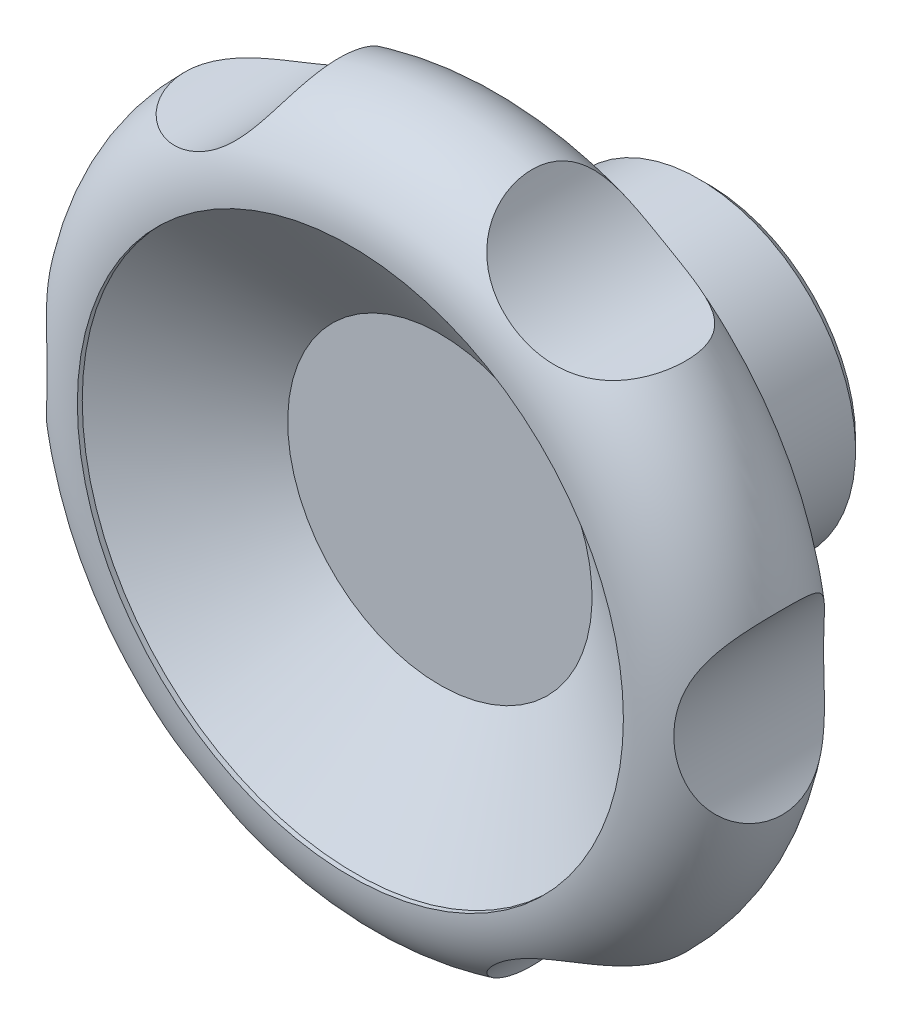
ISO-10303-21;
HEADER;
FILE_DESCRIPTION(('STEP AP214'),'2;1');
FILE_NAME('part.step','',(''),(''),'','','');
FILE_SCHEMA(('AUTOMOTIVE_DESIGN { 1 0 10303 214 1 1 1 1 }'));
ENDSEC;
DATA;
#1=APPLICATION_CONTEXT('core data for automotive mechanical design processes');
#2=APPLICATION_PROTOCOL_DEFINITION('international standard','automotive_design',2000,#1);
#3=PRODUCT_CONTEXT('',#1,'mechanical');
#4=PRODUCT('Part','Part','',(#3));
#5=PRODUCT_RELATED_PRODUCT_CATEGORY('part','',(#4));
#6=PRODUCT_DEFINITION_FORMATION('','',#4);
#7=PRODUCT_DEFINITION_CONTEXT('part definition',#1,'design');
#8=PRODUCT_DEFINITION('design','',#6,#7);
#9=PRODUCT_DEFINITION_SHAPE('','',#8);
#10=(LENGTH_UNIT() NAMED_UNIT(*) SI_UNIT(.MILLI.,.METRE.));
#11=(NAMED_UNIT(*) PLANE_ANGLE_UNIT() SI_UNIT($,.RADIAN.));
#12=(NAMED_UNIT(*) SI_UNIT($,.STERADIAN.) SOLID_ANGLE_UNIT());
#13=UNCERTAINTY_MEASURE_WITH_UNIT(LENGTH_MEASURE(1.E-05),#10,'distance_accuracy_value','');
#14=(GEOMETRIC_REPRESENTATION_CONTEXT(3) GLOBAL_UNCERTAINTY_ASSIGNED_CONTEXT((#13)) GLOBAL_UNIT_ASSIGNED_CONTEXT((#10,
#11,#12)) REPRESENTATION_CONTEXT('',''));
#15=CARTESIAN_POINT('',(0.,0.,0.));
#16=DIRECTION('',(0.,0.,1.));
#17=DIRECTION('',(1.,0.,0.));
#18=AXIS2_PLACEMENT_3D('',#15,#16,#17);
#19=CARTESIAN_POINT('',(0.,0.,7.));
#20=DIRECTION('',(0.,0.,-1.));
#21=DIRECTION('',(-0.499999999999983,-0.866025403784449,0.));
#22=AXIS2_PLACEMENT_3D('',#19,#20,#21);
#23=CONICAL_SURFACE('',#22,0.,0.785398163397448);
#24=CARTESIAN_POINT('',(0.,0.,0.));
#25=DIRECTION('',(0.,0.,-1.));
#26=DIRECTION('',(-0.499999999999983,-0.866025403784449,0.));
#27=AXIS2_PLACEMENT_3D('',#24,#25,#26);
#28=CIRCLE('',#27,7.);
#29=CARTESIAN_POINT('',(-3.49999999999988,-6.06217782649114,0.));
#30=VERTEX_POINT('',#29);
#31=EDGE_CURVE('E40',#30,#30,#28,.T.);
#32=ORIENTED_EDGE('',*,*,#31,.T.);
#33=EDGE_LOOP('',(#32));
#34=FACE_BOUND('',#33,.T.);
#35=CARTESIAN_POINT('',(0.,0.,7.));
#36=VERTEX_POINT('',#35);
#37=VERTEX_LOOP('',#36);
#38=FACE_BOUND('',#37,.T.);
#39=ADVANCED_FACE('F14',(#34,#38),#23,.F.);
#40=CARTESIAN_POINT('',(3.49999999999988,6.06217782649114,0.));
#41=DIRECTION('',(0.,0.,-1.));
#42=DIRECTION('',(-0.499999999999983,-0.866025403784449,0.));
#43=AXIS2_PLACEMENT_3D('',#40,#41,#42);
#44=PLANE('',#43);
#45=CARTESIAN_POINT('',(0.,0.,0.));
#46=DIRECTION('',(0.,0.,-1.));
#47=DIRECTION('',(-0.499999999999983,-0.866025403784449,0.));
#48=AXIS2_PLACEMENT_3D('',#45,#46,#47);
#49=CIRCLE('',#48,16.43933982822);
#50=CARTESIAN_POINT('',(-8.21966991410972,-14.236885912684,0.));
#51=VERTEX_POINT('',#50);
#52=EDGE_CURVE('E43',#51,#51,#49,.T.);
#53=ORIENTED_EDGE('',*,*,#52,.T.);
#54=EDGE_LOOP('',(#53));
#55=FACE_BOUND('',#54,.T.);
#56=ORIENTED_EDGE('',*,*,#31,.F.);
#57=EDGE_LOOP('',(#56));
#58=FACE_BOUND('',#57,.T.);
#59=ADVANCED_FACE('F29',(#55,#58),#44,.T.);
#60=CARTESIAN_POINT('',(0.,0.,0.));
#61=DIRECTION('',(0.,0.,1.));
#62=DIRECTION('',(0.499999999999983,0.866025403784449,0.));
#63=AXIS2_PLACEMENT_3D('',#60,#61,#62);
#64=CONICAL_SURFACE('',#63,16.43933982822,0.785398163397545);
#65=CARTESIAN_POINT('',(0.,0.,1.0606601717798));
#66=DIRECTION('',(0.,0.,-1.));
#67=DIRECTION('',(-0.499999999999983,-0.866025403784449,0.));
#68=AXIS2_PLACEMENT_3D('',#65,#66,#67);
#69=CIRCLE('',#68,17.5);
#70=CARTESIAN_POINT('',(-8.7499999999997,-15.1554445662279,1.0606601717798));
#71=VERTEX_POINT('',#70);
#72=EDGE_CURVE('E49',#71,#71,#69,.T.);
#73=ORIENTED_EDGE('',*,*,#72,.T.);
#74=EDGE_LOOP('',(#73));
#75=FACE_BOUND('',#74,.T.);
#76=ORIENTED_EDGE('',*,*,#52,.F.);
#77=EDGE_LOOP('',(#76));
#78=FACE_BOUND('',#77,.T.);
#79=ADVANCED_FACE('F36',(#75,#78),#64,.T.);
#80=CARTESIAN_POINT('',(0.,0.,40.));
#81=DIRECTION('',(0.,0.,-1.));
#82=DIRECTION('',(-0.499999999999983,-0.866025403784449,0.));
#83=AXIS2_PLACEMENT_3D('',#80,#81,#82);
#84=CYLINDRICAL_SURFACE('',#83,17.5);
#85=CARTESIAN_POINT('',(0.,0.,15.));
#86=DIRECTION('',(0.,0.,-1.));
#87=DIRECTION('',(-0.499999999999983,-0.866025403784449,0.));
#88=AXIS2_PLACEMENT_3D('',#85,#86,#87);
#89=CIRCLE('',#88,17.5);
#90=CARTESIAN_POINT('',(-8.7499999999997,-15.1554445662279,15.));
#91=VERTEX_POINT('',#90);
#92=EDGE_CURVE('E143',#91,#91,#89,.T.);
#93=ORIENTED_EDGE('',*,*,#92,.T.);
#94=EDGE_LOOP('',(#93));
#95=FACE_BOUND('',#94,.T.);
#96=ORIENTED_EDGE('',*,*,#72,.F.);
#97=EDGE_LOOP('',(#96));
#98=FACE_BOUND('',#97,.T.);
#99=ADVANCED_FACE('F150',(#95,#98),#84,.T.);
#100=CARTESIAN_POINT('',(8.7499999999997,15.1554445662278,15.));
#101=DIRECTION('',(0.,0.,-1.));
#102=DIRECTION('',(-0.499999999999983,-0.866025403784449,0.));
#103=AXIS2_PLACEMENT_3D('',#100,#101,#102);
#104=PLANE('',#103);
#105=CARTESIAN_POINT('',(0.,0.,15.));
#106=DIRECTION('',(0.,0.,-1.));
#107=DIRECTION('',(-0.499999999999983,-0.866025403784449,0.));
#108=AXIS2_PLACEMENT_3D('',#105,#106,#107);
#109=CIRCLE('',#108,23.);
#110=CARTESIAN_POINT('',(-11.4999999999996,-19.9185842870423,15.));
#111=VERTEX_POINT('',#110);
#112=EDGE_CURVE('E140',#111,#111,#109,.T.);
#113=ORIENTED_EDGE('',*,*,#112,.T.);
#114=EDGE_LOOP('',(#113));
#115=FACE_BOUND('',#114,.T.);
#116=ORIENTED_EDGE('',*,*,#92,.F.);
#117=EDGE_LOOP('',(#116));
#118=FACE_BOUND('',#117,.T.);
#119=ADVANCED_FACE('F152',(#115,#118),#104,.T.);
#120=CARTESIAN_POINT('',(0.,0.,15.));
#121=DIRECTION('',(0.,0.,1.));
#122=DIRECTION('',(0.499999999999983,0.866025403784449,0.));
#123=AXIS2_PLACEMENT_3D('',#120,#121,#122);
#124=CONICAL_SURFACE('',#123,23.,0.10471975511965);
#125=CARTESIAN_POINT('',(0.,0.,21.));
#126=DIRECTION('',(0.,0.,-1.));
#127=DIRECTION('',(-0.499999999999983,-0.866025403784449,0.));
#128=AXIS2_PLACEMENT_3D('',#125,#126,#127);
#129=CIRCLE('',#128,23.630625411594);
#130=CARTESIAN_POINT('',(-11.8153127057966,-20.4647219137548,21.));
#131=VERTEX_POINT('',#130);
#132=EDGE_CURVE('E132',#131,#131,#129,.T.);
#133=ORIENTED_EDGE('',*,*,#132,.T.);
#134=EDGE_LOOP('',(#133));
#135=FACE_BOUND('',#134,.T.);
#136=ORIENTED_EDGE('',*,*,#112,.F.);
#137=EDGE_LOOP('',(#136));
#138=FACE_BOUND('',#137,.T.);
#139=ADVANCED_FACE('F160',(#135,#138),#124,.T.);
#140=CARTESIAN_POINT('',(11.8153127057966,20.4647219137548,21.));
#141=DIRECTION('',(0.,0.,-1.));
#142=DIRECTION('',(-0.499999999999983,-0.866025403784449,0.));
#143=AXIS2_PLACEMENT_3D('',#140,#141,#142);
#144=PLANE('',#143);
#145=CARTESIAN_POINT('',(0.,0.,21.));
#146=DIRECTION('',(0.,0.,-1.));
#147=DIRECTION('',(-0.499999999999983,-0.866025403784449,0.));
#148=AXIS2_PLACEMENT_3D('',#145,#146,#147);
#149=CIRCLE('',#148,30.5);
#150=CARTESIAN_POINT('',(-15.2499999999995,-26.4137748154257,21.));
#151=VERTEX_POINT('',#150);
#152=EDGE_CURVE('E129',#151,#151,#149,.T.);
#153=ORIENTED_EDGE('',*,*,#152,.T.);
#154=EDGE_LOOP('',(#153));
#155=FACE_BOUND('',#154,.T.);
#156=ORIENTED_EDGE('',*,*,#132,.F.);
#157=EDGE_LOOP('',(#156));
#158=FACE_BOUND('',#157,.T.);
#159=ADVANCED_FACE('F119',(#155,#158),#144,.T.);
#160=CARTESIAN_POINT('',(0.,0.,30.5));
#161=DIRECTION('',(0.,0.,-1.));
#162=DIRECTION('',(-0.499999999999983,-0.866025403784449,0.));
#163=AXIS2_PLACEMENT_3D('',#160,#161,#162);
#164=TOROIDAL_SURFACE('',#163,30.5,9.5);
#165=CARTESIAN_POINT('',(24.4759899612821,28.3104267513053,23.9955011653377));
#166=CARTESIAN_POINT('',(24.2555066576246,28.3181359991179,23.8482104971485));
#167=CARTESIAN_POINT('',(24.0283728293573,28.3309613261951,23.7111043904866));
#168=CARTESIAN_POINT('',(23.5640687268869,28.3683407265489,23.4569451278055));
#169=CARTESIAN_POINT('',(23.3268961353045,28.3928975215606,23.3398966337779));
#170=CARTESIAN_POINT('',(22.845383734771,28.4548355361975,23.1248057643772));
#171=CARTESIAN_POINT('',(22.6010353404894,28.4922327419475,23.0267873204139));
#172=CARTESIAN_POINT('',(22.1083461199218,28.5805031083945,22.8486031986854));
#173=CARTESIAN_POINT('',(21.8600053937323,28.6313759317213,22.7684370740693));
#174=CARTESIAN_POINT('',(21.3640247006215,28.7464106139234,22.6250397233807));
#175=CARTESIAN_POINT('',(21.1163975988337,28.8104523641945,22.561666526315));
#176=CARTESIAN_POINT('',(20.6217813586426,28.9521450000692,22.4494252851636));
#177=CARTESIAN_POINT('',(20.3747922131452,29.0297957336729,22.4005570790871));
#178=CARTESIAN_POINT('',(19.8832204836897,29.1985718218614,22.3159461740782));
#179=CARTESIAN_POINT('',(19.6386377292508,29.2896962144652,22.2802025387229));
#180=CARTESIAN_POINT('',(19.1533267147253,29.4851612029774,22.2206987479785));
#181=CARTESIAN_POINT('',(18.9125987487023,29.5895028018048,22.1969395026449));
#182=CARTESIAN_POINT('',(18.3983436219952,29.8286752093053,22.1576867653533));
#183=CARTESIAN_POINT('',(18.1256942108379,29.9657155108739,22.1441107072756));
#184=CARTESIAN_POINT('',(17.588998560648,30.256339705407,22.1312848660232));
#185=CARTESIAN_POINT('',(17.3249530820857,30.4099250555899,22.1320363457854));
#186=CARTESIAN_POINT('',(16.8066686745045,30.7329497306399,22.1479179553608));
#187=CARTESIAN_POINT('',(16.5524439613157,30.902410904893,22.1630681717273));
#188=CARTESIAN_POINT('',(16.0556873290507,31.2558478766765,22.2085166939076));
#189=CARTESIAN_POINT('',(15.8131557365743,31.4398240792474,22.2388154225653));
#190=CARTESIAN_POINT('',(15.320639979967,31.837471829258,22.3193242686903));
#191=CARTESIAN_POINT('',(15.0718566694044,32.0523334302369,22.3710430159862));
#192=CARTESIAN_POINT('',(14.5918121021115,32.4949664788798,22.4965629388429));
#193=CARTESIAN_POINT('',(14.360553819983,32.7227401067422,22.5703678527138));
#194=CARTESIAN_POINT('',(13.9182055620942,33.1871033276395,22.7428215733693));
#195=CARTESIAN_POINT('',(13.7070636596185,33.4236679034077,22.8414038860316));
#196=CARTESIAN_POINT('',(13.3062724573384,33.9015987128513,23.0665093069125));
#197=CARTESIAN_POINT('',(13.1166104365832,34.1429620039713,23.1930157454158));
#198=CARTESIAN_POINT('',(12.817716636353,34.5472207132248,23.43075085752));
#199=CARTESIAN_POINT('',(12.7022463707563,34.7103662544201,23.5337900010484));
#200=CARTESIAN_POINT('',(12.482239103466,35.0342312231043,23.7543039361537));
#201=CARTESIAN_POINT('',(12.3776993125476,35.194951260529,23.8717750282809));
#202=CARTESIAN_POINT('',(12.1797689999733,35.5117537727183,24.1212923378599));
#203=CARTESIAN_POINT('',(12.0863736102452,35.6678382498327,24.2533321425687));
#204=CARTESIAN_POINT('',(11.9106556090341,35.9732346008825,24.5318597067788));
#205=CARTESIAN_POINT('',(11.8283334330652,36.122546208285,24.6783480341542));
#206=CARTESIAN_POINT('',(11.6743021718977,36.4126674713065,24.9857013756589));
#207=CARTESIAN_POINT('',(11.6026268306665,36.5534492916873,25.1466096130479));
#208=CARTESIAN_POINT('',(11.46976746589,36.8239615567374,25.4815215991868));
#209=CARTESIAN_POINT('',(11.4085835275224,36.9536919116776,25.6555254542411));
#210=CARTESIAN_POINT('',(11.2961046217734,37.2003163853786,26.0154992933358));
#211=CARTESIAN_POINT('',(11.2448125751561,37.3172067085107,26.2014727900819));
#212=CARTESIAN_POINT('',(11.1514515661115,37.5365564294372,26.5839408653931));
#213=CARTESIAN_POINT('',(11.1093823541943,37.6390162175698,26.7804351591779));
#214=CARTESIAN_POINT('',(11.0356721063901,37.823414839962,27.1721374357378));
#215=CARTESIAN_POINT('',(11.0036085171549,37.906133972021,27.3668995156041));
#216=CARTESIAN_POINT('',(10.9465346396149,38.0565976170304,27.7631167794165));
#217=CARTESIAN_POINT('',(10.9215240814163,38.1243427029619,27.9645717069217));
#218=CARTESIAN_POINT('',(10.8780206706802,38.2442187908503,28.372758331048));
#219=CARTESIAN_POINT('',(10.859527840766,38.2963497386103,28.5794900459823));
#220=CARTESIAN_POINT('',(10.8286224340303,38.3845393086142,28.9968022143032));
#221=CARTESIAN_POINT('',(10.8162100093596,38.4205975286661,29.207382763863));
#222=CARTESIAN_POINT('',(10.7969853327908,38.4768245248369,29.6346432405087));
#223=CARTESIAN_POINT('',(10.7902742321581,38.4967060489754,29.8513655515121));
#224=CARTESIAN_POINT('',(10.782636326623,38.5193550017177,30.2858040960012));
#225=CARTESIAN_POINT('',(10.7817095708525,38.522122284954,30.5035203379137));
#226=CARTESIAN_POINT('',(10.7856148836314,38.5105193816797,30.9384699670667));
#227=CARTESIAN_POINT('',(10.790447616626,38.4961472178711,31.155703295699));
#228=CARTESIAN_POINT('',(10.8060065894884,38.4503801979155,31.5881583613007));
#229=CARTESIAN_POINT('',(10.8167328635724,38.4189852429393,31.803380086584));
#230=CARTESIAN_POINT('',(10.8445576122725,38.3388843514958,32.2332773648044));
#231=CARTESIAN_POINT('',(10.8617426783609,38.2899436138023,32.4479036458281));
#232=CARTESIAN_POINT('',(10.9029086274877,38.1752852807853,32.8719656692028));
#233=CARTESIAN_POINT('',(10.9268895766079,38.1095675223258,33.0814013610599));
#234=CARTESIAN_POINT('',(10.9822037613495,37.962020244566,33.4934720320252));
#235=CARTESIAN_POINT('',(11.0135354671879,37.8801940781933,33.6961084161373));
#236=CARTESIAN_POINT('',(11.0841977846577,37.7012977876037,34.0930876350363));
#237=CARTESIAN_POINT('',(11.1235282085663,37.6042280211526,34.2874306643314));
#238=CARTESIAN_POINT('',(11.2101383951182,37.3977089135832,34.6631961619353));
#239=CARTESIAN_POINT('',(11.2572745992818,37.2884931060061,34.8447800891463));
#240=CARTESIAN_POINT('',(11.3605651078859,37.0577306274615,35.1972292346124));
#241=CARTESIAN_POINT('',(11.416719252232,36.9361841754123,35.3680946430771));
#242=CARTESIAN_POINT('',(11.5385820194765,36.6823556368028,35.6979451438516));
#243=CARTESIAN_POINT('',(11.6042877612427,36.5500767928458,35.8569337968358));
#244=CARTESIAN_POINT('',(11.7456975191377,36.2765165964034,36.1622036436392));
#245=CARTESIAN_POINT('',(11.8214014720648,36.135235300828,36.3084849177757));
#246=CARTESIAN_POINT('',(11.9819640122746,35.8475805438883,36.5858162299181));
#247=CARTESIAN_POINT('',(12.0666823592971,35.7013038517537,36.7170480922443));
#248=CARTESIAN_POINT('',(12.2461903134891,35.403769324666,36.9662868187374));
#249=CARTESIAN_POINT('',(12.3409797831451,35.2525115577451,37.0842938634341));
#250=CARTESIAN_POINT('',(12.5405678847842,34.9468781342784,37.3071310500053));
#251=CARTESIAN_POINT('',(12.6453687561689,34.7925017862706,37.4119582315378));
#252=CARTESIAN_POINT('',(12.8647253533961,34.4824735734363,37.608706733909));
#253=CARTESIAN_POINT('',(12.9792815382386,34.3268216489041,37.7006274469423));
#254=CARTESIAN_POINT('',(13.226452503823,34.0046183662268,37.8783144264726));
#255=CARTESIAN_POINT('',(13.3597745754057,33.8380964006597,37.9631489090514));
#256=CARTESIAN_POINT('',(13.6366697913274,33.5073302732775,38.1194280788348));
#257=CARTESIAN_POINT('',(13.7802433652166,33.3430862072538,38.1908722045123));
#258=CARTESIAN_POINT('',(14.0770695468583,33.0183719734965,38.3213750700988));
#259=CARTESIAN_POINT('',(14.2303257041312,32.8579032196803,38.3804292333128));
#260=CARTESIAN_POINT('',(14.5458277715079,32.5420821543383,38.4871341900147));
#261=CARTESIAN_POINT('',(14.7080748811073,32.3867305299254,38.5347834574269));
#262=CARTESIAN_POINT('',(15.072330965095,32.0534584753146,38.6276493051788));
#263=CARTESIAN_POINT('',(15.2760626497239,31.8768162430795,38.6707072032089));
#264=CARTESIAN_POINT('',(15.6942044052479,31.5337155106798,38.7434590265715));
#265=CARTESIAN_POINT('',(15.9086155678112,31.3672580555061,38.7731515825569));
#266=CARTESIAN_POINT('',(16.3472782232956,31.0454767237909,38.8202628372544));
#267=CARTESIAN_POINT('',(16.5715399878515,30.8901649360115,38.8376683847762));
#268=CARTESIAN_POINT('',(17.028626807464,30.5917570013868,38.8608203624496));
#269=CARTESIAN_POINT('',(17.2614522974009,30.4486614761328,38.866566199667));
#270=CARTESIAN_POINT('',(17.7777433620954,30.1504790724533,38.8666402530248));
#271=CARTESIAN_POINT('',(18.0627019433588,29.9979630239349,38.8586956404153));
#272=CARTESIAN_POINT('',(18.6411781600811,29.711953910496,38.826403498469));
#273=CARTESIAN_POINT('',(18.9346973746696,29.5784643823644,38.8020529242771));
#274=CARTESIAN_POINT('',(19.5278513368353,29.3313473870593,38.735669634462));
#275=CARTESIAN_POINT('',(19.8274823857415,29.2177082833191,38.6936473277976));
#276=CARTESIAN_POINT('',(20.4302994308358,29.0107385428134,38.589889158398));
#277=CARTESIAN_POINT('',(20.7334843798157,28.9174020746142,38.5281589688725));
#278=CARTESIAN_POINT('',(21.2755603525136,28.7688958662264,38.397919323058));
#279=CARTESIAN_POINT('',(21.5144090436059,28.7098307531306,38.3336451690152));
#280=CARTESIAN_POINT('',(21.9903220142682,28.604290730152,38.1899062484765));
#281=CARTESIAN_POINT('',(22.227386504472,28.5578143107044,38.1104433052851));
#282=CARTESIAN_POINT('',(22.6972643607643,28.4771622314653,37.9350757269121));
#283=CARTESIAN_POINT('',(22.9300815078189,28.4429750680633,37.8391865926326));
#284=CARTESIAN_POINT('',(23.3891494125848,28.3862225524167,37.6297772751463));
#285=CARTESIAN_POINT('',(23.6154001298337,28.3636572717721,37.5162569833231));
#286=CARTESIAN_POINT('',(24.0604641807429,28.3290453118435,37.2697539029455));
#287=CARTESIAN_POINT('',(24.2791974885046,28.3170901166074,37.1366131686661));
#288=CARTESIAN_POINT('',(24.7042553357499,28.3026780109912,36.851308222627));
#289=CARTESIAN_POINT('',(24.9105797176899,28.3002212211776,36.6991437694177));
#290=CARTESIAN_POINT('',(25.3079304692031,28.3031149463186,36.3761576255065));
#291=CARTESIAN_POINT('',(25.4989613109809,28.3084631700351,36.2053414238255));
#292=CARTESIAN_POINT('',(25.8632263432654,28.3250190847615,35.8459538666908));
#293=CARTESIAN_POINT('',(26.03646286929,28.336226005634,35.6573848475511));
#294=CARTESIAN_POINT('',(26.34085857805,28.3606488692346,35.290676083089));
#295=CARTESIAN_POINT('',(26.4745381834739,28.3733864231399,35.114588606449));
#296=CARTESIAN_POINT('',(26.7259250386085,28.4003585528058,34.7514831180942));
#297=CARTESIAN_POINT('',(26.8436338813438,28.4145929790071,34.5644661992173));
#298=CARTESIAN_POINT('',(27.0622498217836,28.4432996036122,34.1808807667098));
#299=CARTESIAN_POINT('',(27.1631568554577,28.4577718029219,33.9843122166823));
#300=CARTESIAN_POINT('',(27.3475726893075,28.4858185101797,33.5831138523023));
#301=CARTESIAN_POINT('',(27.4310812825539,28.4993930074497,33.3784839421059));
#302=CARTESIAN_POINT('',(27.5779430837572,28.5242751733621,32.9692669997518));
#303=CARTESIAN_POINT('',(27.6418474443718,28.5356406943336,32.764880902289));
#304=CARTESIAN_POINT('',(27.7527139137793,28.555906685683,32.3514528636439));
#305=CARTESIAN_POINT('',(27.7996765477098,28.5648072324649,32.1424110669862));
#306=CARTESIAN_POINT('',(27.8765201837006,28.5796138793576,31.7211003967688));
#307=CARTESIAN_POINT('',(27.9064004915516,28.5855198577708,31.5088313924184));
#308=CARTESIAN_POINT('',(27.949000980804,28.5939976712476,31.08250951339));
#309=CARTESIAN_POINT('',(27.961720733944,28.5965694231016,30.8684565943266));
#310=CARTESIAN_POINT('',(27.970066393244,28.5982525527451,30.4349552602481));
#311=CARTESIAN_POINT('',(27.9652825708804,28.5972809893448,30.2154985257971));
#312=CARTESIAN_POINT('',(27.9377149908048,28.591748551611,29.7777613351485));
#313=CARTESIAN_POINT('',(27.9149309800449,28.5871876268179,29.5594808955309));
#314=CARTESIAN_POINT('',(27.8514183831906,28.5747478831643,29.1256255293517));
#315=CARTESIAN_POINT('',(27.8106886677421,28.5668688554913,28.9100507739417));
#316=CARTESIAN_POINT('',(27.7114045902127,28.5482761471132,28.4831685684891));
#317=CARTESIAN_POINT('',(27.6528503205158,28.5375624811,28.2718610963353));
#318=CARTESIAN_POINT('',(27.5179284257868,28.5139534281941,27.8544434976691));
#319=CARTESIAN_POINT('',(27.4415089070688,28.5010517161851,27.648350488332));
#320=CARTESIAN_POINT('',(27.2712913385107,28.4739758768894,27.2435531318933));
#321=CARTESIAN_POINT('',(27.1774933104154,28.4598017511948,27.0448487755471));
#322=CARTESIAN_POINT('',(26.9730688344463,28.4312453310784,26.6563984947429));
#323=CARTESIAN_POINT('',(26.8624485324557,28.4168631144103,26.4666493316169));
#324=CARTESIAN_POINT('',(26.6250823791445,28.3890813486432,26.097445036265));
#325=CARTESIAN_POINT('',(26.4983368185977,28.3756817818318,25.9179897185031));
#326=CARTESIAN_POINT('',(26.2323742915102,28.3513966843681,25.5741022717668));
#327=CARTESIAN_POINT('',(26.093456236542,28.3404663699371,25.4094420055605));
#328=CARTESIAN_POINT('',(25.8022342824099,28.3220279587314,25.0922291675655));
#329=CARTESIAN_POINT('',(25.6499310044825,28.3145197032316,24.9396760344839));
#330=CARTESIAN_POINT('',(25.3333109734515,28.3041377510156,24.647415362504));
#331=CARTESIAN_POINT('',(25.1689938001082,28.3012642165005,24.5077082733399));
#332=CARTESIAN_POINT('',(24.8299124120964,28.3012761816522,24.2415917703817));
#333=CARTESIAN_POINT('',(24.6551467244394,28.3041624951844,24.1151842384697));
#334=CARTESIAN_POINT('',(24.4759899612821,28.3104267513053,23.9955011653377));
#335=B_SPLINE_CURVE_WITH_KNOTS('',3,(#165,#166,#167,#168,#169,#170,#171,#172,#173,#174,#175,
#176,#177,#178,#179,#180,#181,#182,#183,#184,#185,#186,#187,#188,#189,#190,#191,#192,#193,#194,
#195,#196,#197,#198,#199,#200,#201,#202,#203,#204,#205,#206,#207,#208,#209,#210,#211,#212,#213,
#214,#215,#216,#217,#218,#219,#220,#221,#222,#223,#224,#225,#226,#227,#228,#229,#230,#231,#232,
#233,#234,#235,#236,#237,#238,#239,#240,#241,#242,#243,#244,#245,#246,#247,#248,#249,#250,#251,
#252,#253,#254,#255,#256,#257,#258,#259,#260,#261,#262,#263,#264,#265,#266,#267,#268,#269,#270,
#271,#272,#273,#274,#275,#276,#277,#278,#279,#280,#281,#282,#283,#284,#285,#286,#287,#288,#289,
#290,#291,#292,#293,#294,#295,#296,#297,#298,#299,#300,#301,#302,#303,#304,#305,#306,#307,#308,
#309,#310,#311,#312,#313,#314,#315,#316,#317,#318,#319,#320,#321,#322,#323,#324,#325,#326,#327,
#328,#329,#330,#331,#332,#333,#334),.UNSPECIFIED.,.T.,.F.,(4,2,2,2,2,2,2,2,2,2,2,2,2,2,2,2,2,2,
2,2,2,2,2,2,2,2,2,2,2,2,2,2,2,2,2,2,2,2,2,2,2,2,2,2,2,2,2,2,2,2,2,2,2,2,2,2,2,2,2,2,2,2,2,2,2,2,
2,2,2,2,2,2,2,2,2,2,2,2,2,2,2,2,2,2,4),(0.,0.795542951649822,1.59127056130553,2.3879924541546,
3.18469440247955,3.97442888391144,4.76415454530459,5.55382384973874,6.34355311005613,
7.25897516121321,8.17447790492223,9.09125967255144,10.0080670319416,11.0049920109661,
12.0020858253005,12.9965318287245,13.9903857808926,14.6643347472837,15.3381113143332,
16.0115924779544,16.6851001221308,17.3606988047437,18.036302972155,18.7121063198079,
19.3878913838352,20.0291961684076,20.6704764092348,21.3117588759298,21.953057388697,
22.605509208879,23.2579665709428,23.910499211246,24.5630356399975,25.2246520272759,
25.8862748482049,26.547760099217,27.2092298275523,27.8596647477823,28.510088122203,
29.1603157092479,29.8105391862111,30.4518191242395,31.093090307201,31.7345052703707,
32.3759504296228,33.0639802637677,33.752038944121,34.4403513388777,35.1287557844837,
35.9471617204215,36.7656514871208,37.5850159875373,38.4044221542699,39.3732329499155,
40.3422236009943,41.3106442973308,42.2787864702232,43.040987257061,43.8030966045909,
44.5644906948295,45.3258894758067,46.093791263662,46.8617027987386,47.6293889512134,
48.396974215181,49.0604901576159,49.7239398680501,50.3873921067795,51.050852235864,
51.6934525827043,52.3360330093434,52.9786395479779,53.6212621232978,54.279022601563,
54.9367923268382,55.5946034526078,56.2524111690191,56.9121539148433,57.5718958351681,
58.2313973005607,58.8908868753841,59.5372323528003,60.183547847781,60.8298859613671,
61.476315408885),.UNSPECIFIED.);
#336=CARTESIAN_POINT('',(24.4759899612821,28.3104267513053,23.9955011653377));
#337=VERTEX_POINT('',#336);
#338=EDGE_CURVE('E9',#337,#337,#335,.T.);
#339=ORIENTED_EDGE('',*,*,#338,.F.);
#340=EDGE_LOOP('',(#339));
#341=FACE_BOUND('',#340,.T.);
#342=CARTESIAN_POINT('',(36.6805192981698,-6.89865449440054,23.8902848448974));
#343=CARTESIAN_POINT('',(36.5764950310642,-6.69780592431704,23.7464219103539));
#344=CARTESIAN_POINT('',(36.4739386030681,-6.48862971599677,23.612896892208));
#345=CARTESIAN_POINT('',(36.2747174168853,-6.05586116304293,23.3660918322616));
#346=CARTESIAN_POINT('',(36.1780580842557,-5.83225592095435,23.2528302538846));
#347=CARTESIAN_POINT('',(35.9928204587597,-5.37220745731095,23.0451920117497));
#348=CARTESIAN_POINT('',(35.9042713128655,-5.13572245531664,22.9508821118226));
#349=CARTESIAN_POINT('',(35.7376162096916,-4.65291671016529,22.7801957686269));
#350=CARTESIAN_POINT('',(35.659508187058,-4.4065979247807,22.7038157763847));
#351=CARTESIAN_POINT('',(35.5158823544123,-3.90856266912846,22.5679952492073));
#352=CARTESIAN_POINT('',(35.4502495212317,-3.65692195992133,22.5083972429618));
#353=CARTESIAN_POINT('',(35.3316638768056,-3.14773933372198,22.4036147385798));
#354=CARTESIAN_POINT('',(35.278711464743,-2.89019723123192,22.3584306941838));
#355=CARTESIAN_POINT('',(35.1862134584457,-2.37091864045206,22.2811299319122));
#356=CARTESIAN_POINT('',(35.1466619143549,-2.10918406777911,22.2490074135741));
#357=CARTESIAN_POINT('',(35.0813859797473,-1.58281644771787,22.1967227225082));
#358=CARTESIAN_POINT('',(35.0556623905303,-1.31818323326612,22.1765612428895));
#359=CARTESIAN_POINT('',(35.0153069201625,-0.744569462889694,22.1451245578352));
#360=CARTESIAN_POINT('',(35.0031262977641,-0.435305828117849,22.1358016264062));
#361=CARTESIAN_POINT('',(34.9979304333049,0.183506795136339,22.1318098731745));
#362=CARTESIAN_POINT('',(35.0049177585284,0.493055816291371,22.1371430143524));
#363=CARTESIAN_POINT('',(35.0379774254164,1.1106495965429,22.1627458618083));
#364=CARTESIAN_POINT('',(35.0640575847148,1.41869368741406,22.183021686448));
#365=CARTESIAN_POINT('',(35.1349571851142,2.03112939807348,22.2395139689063));
#366=CARTESIAN_POINT('',(35.1797740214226,2.33552151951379,22.2757282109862));
#367=CARTESIAN_POINT('',(35.2814288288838,2.90476751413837,22.3607199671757));
#368=CARTESIAN_POINT('',(35.336364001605,3.17023882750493,22.4076415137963));
#369=CARTESIAN_POINT('',(35.4596877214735,3.69484711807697,22.5168784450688));
#370=CARTESIAN_POINT('',(35.5280760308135,3.95398420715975,22.5791935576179));
#371=CARTESIAN_POINT('',(35.677054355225,4.4635857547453,22.720816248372));
#372=CARTESIAN_POINT('',(35.7576271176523,4.71406187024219,22.8000998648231));
#373=CARTESIAN_POINT('',(35.9294412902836,5.20450176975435,22.9774297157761));
#374=CARTESIAN_POINT('',(36.0206806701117,5.4444675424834,23.0754723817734));
#375=CARTESIAN_POINT('',(36.1956437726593,5.87229649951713,23.2736621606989));
#376=CARTESIAN_POINT('',(36.2780571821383,6.06214283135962,23.3706918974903));
#377=CARTESIAN_POINT('',(36.4472573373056,6.43151683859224,23.5794407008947));
#378=CARTESIAN_POINT('',(36.5340432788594,6.61104639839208,23.6911570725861));
#379=CARTESIAN_POINT('',(36.7102094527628,6.95840414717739,23.9296232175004));
#380=CARTESIAN_POINT('',(36.7995889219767,7.12623572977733,24.0563686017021));
#381=CARTESIAN_POINT('',(36.979009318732,7.44902034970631,24.3249291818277));
#382=CARTESIAN_POINT('',(37.0690502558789,7.60397319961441,24.4667445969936));
#383=CARTESIAN_POINT('',(37.248057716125,7.90051188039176,24.7656270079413));
#384=CARTESIAN_POINT('',(37.3370188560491,8.04204467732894,24.9227499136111));
#385=CARTESIAN_POINT('',(37.5114012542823,8.31026491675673,25.2510190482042));
#386=CARTESIAN_POINT('',(37.5968224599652,8.4369521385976,25.422165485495));
#387=CARTESIAN_POINT('',(37.7621056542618,8.67496114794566,25.7773982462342));
#388=CARTESIAN_POINT('',(37.8419665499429,8.78627991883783,25.9614870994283));
#389=CARTESIAN_POINT('',(37.9942417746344,8.9932355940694,26.3411903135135));
#390=CARTESIAN_POINT('',(38.0666564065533,9.0888731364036,26.536804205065));
#391=CARTESIAN_POINT('',(38.1979397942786,9.25862421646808,26.9247903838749));
#392=CARTESIAN_POINT('',(38.2573860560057,9.3337393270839,27.1165306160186));
#393=CARTESIAN_POINT('',(38.3672268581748,9.47028360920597,27.5073260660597));
#394=CARTESIAN_POINT('',(38.4176218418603,9.53171345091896,27.7063809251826));
#395=CARTESIAN_POINT('',(38.5084450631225,9.64101748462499,28.1103947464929));
#396=CARTESIAN_POINT('',(38.5488732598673,9.68889162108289,28.3153537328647));
#397=CARTESIAN_POINT('',(38.6190570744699,9.77123671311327,28.7297447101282));
#398=CARTESIAN_POINT('',(38.6488124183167,9.80570732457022,28.939176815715));
#399=CARTESIAN_POINT('',(38.6974624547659,9.86174645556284,29.3638380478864));
#400=CARTESIAN_POINT('',(38.7162096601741,9.8831399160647,29.5791071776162));
#401=CARTESIAN_POINT('',(38.741913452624,9.91240974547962,30.0112611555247));
#402=CARTESIAN_POINT('',(38.7488699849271,9.92028605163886,30.2281460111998));
#403=CARTESIAN_POINT('',(38.7508762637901,9.92256105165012,30.6620670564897));
#404=CARTESIAN_POINT('',(38.7459246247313,9.91695817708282,30.8791032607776));
#405=CARTESIAN_POINT('',(38.7241944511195,9.89224336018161,31.3118121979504));
#406=CARTESIAN_POINT('',(38.7074158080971,9.87313129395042,31.5274849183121));
#407=CARTESIAN_POINT('',(38.6619380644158,9.82087429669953,31.9595468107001));
#408=CARTESIAN_POINT('',(38.6330449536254,9.78750079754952,32.1758880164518));
#409=CARTESIAN_POINT('',(38.5638418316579,9.70655028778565,32.60404486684));
#410=CARTESIAN_POINT('',(38.5235316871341,9.65897311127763,32.8158604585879));
#411=CARTESIAN_POINT('',(38.4322466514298,9.54945857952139,33.2333601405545));
#412=CARTESIAN_POINT('',(38.3812734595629,9.48752351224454,33.4390452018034));
#413=CARTESIAN_POINT('',(38.26963894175,9.34914573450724,33.8427641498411));
#414=CARTESIAN_POINT('',(38.2089778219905,9.27270333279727,34.0407981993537));
#415=CARTESIAN_POINT('',(38.0800872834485,9.10640352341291,34.4250254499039));
#416=CARTESIAN_POINT('',(38.0119748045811,9.01674738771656,34.6113449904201));
#417=CARTESIAN_POINT('',(37.8688964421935,8.82330945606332,34.9737375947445));
#418=CARTESIAN_POINT('',(37.7939306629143,8.71952787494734,35.1498108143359));
#419=CARTESIAN_POINT('',(37.6387436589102,8.49809417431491,35.49045168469));
#420=CARTESIAN_POINT('',(37.5585242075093,8.3804467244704,35.6550231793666));
#421=CARTESIAN_POINT('',(37.3945233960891,8.13167535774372,35.9717284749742));
#422=CARTESIAN_POINT('',(37.3107420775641,8.00055159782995,36.1238624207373));
#423=CARTESIAN_POINT('',(37.1429076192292,7.72789379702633,36.4123959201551));
#424=CARTESIAN_POINT('',(37.0588852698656,7.58658384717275,36.5490254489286));
#425=CARTESIAN_POINT('',(36.8908487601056,7.29238261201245,36.8091699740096));
#426=CARTESIAN_POINT('',(36.8068345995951,7.1394915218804,36.9326851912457));
#427=CARTESIAN_POINT('',(36.6404432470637,6.82306362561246,37.1665188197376));
#428=CARTESIAN_POINT('',(36.558066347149,6.65952494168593,37.2768348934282));
#429=CARTESIAN_POINT('',(36.3964789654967,6.32290090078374,37.484432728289));
#430=CARTESIAN_POINT('',(36.3172686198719,6.14981513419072,37.5817139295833));
#431=CARTESIAN_POINT('',(36.1587477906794,5.7846081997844,37.7691249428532));
#432=CARTESIAN_POINT('',(36.0797155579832,5.59196785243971,37.8584772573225));
#433=CARTESIAN_POINT('',(35.9280758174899,5.19859544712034,38.0237729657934));
#434=CARTESIAN_POINT('',(35.8554685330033,4.99786310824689,38.0997158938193));
#435=CARTESIAN_POINT('',(35.7177530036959,4.58953832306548,38.239122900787));
#436=CARTESIAN_POINT('',(35.6526474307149,4.38194346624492,38.3025825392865));
#437=CARTESIAN_POINT('',(35.530817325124,3.96115527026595,38.4179648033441));
#438=CARTESIAN_POINT('',(35.4740939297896,3.74796117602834,38.469885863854));
#439=CARTESIAN_POINT('',(35.3603115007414,3.27839425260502,38.571514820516));
#440=CARTESIAN_POINT('',(35.3050214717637,3.02114268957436,38.6191508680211));
#441=CARTESIAN_POINT('',(35.2077874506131,2.50204138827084,38.7011015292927));
#442=CARTESIAN_POINT('',(35.1658447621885,2.2401912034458,38.7354148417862));
#443=CARTESIAN_POINT('',(35.0957705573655,1.71309561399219,38.7918860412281));
#444=CARTESIAN_POINT('',(35.067652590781,1.44784713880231,38.8140320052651));
#445=CARTESIAN_POINT('',(35.0255847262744,0.915528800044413,38.8469114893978));
#446=CARTESIAN_POINT('',(35.0116355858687,0.64845883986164,38.8576443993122));
#447=CARTESIAN_POINT('',(34.9967398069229,0.0622395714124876,38.8691165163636));
#448=CARTESIAN_POINT('',(34.9988130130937,-0.25703850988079,38.8675342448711));
#449=CARTESIAN_POINT('',(35.0232919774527,-0.894400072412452,38.8486470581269));
#450=CARTESIAN_POINT('',(35.0457013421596,-1.21248333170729,38.8313393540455));
#451=CARTESIAN_POINT('',(35.1105267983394,-1.84517610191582,38.7800855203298));
#452=CARTESIAN_POINT('',(35.1529369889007,-2.15978660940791,38.7461442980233));
#453=CARTESIAN_POINT('',(35.2570881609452,-2.78322749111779,38.659951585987));
#454=CARTESIAN_POINT('',(35.3188246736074,-3.09205918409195,38.6077043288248));
#455=CARTESIAN_POINT('',(35.4476060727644,-3.64601362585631,38.4939590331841));
#456=CARTESIAN_POINT('',(35.5116581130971,-3.89253355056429,38.4358567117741));
#457=CARTESIAN_POINT('',(35.6509662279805,-4.37824423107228,38.304392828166));
#458=CARTESIAN_POINT('',(35.7262211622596,-4.61743572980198,38.2310328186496));
#459=CARTESIAN_POINT('',(35.8865467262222,-5.08643221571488,38.0676391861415));
#460=CARTESIAN_POINT('',(35.9716085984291,-5.31624533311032,37.9776203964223));
#461=CARTESIAN_POINT('',(36.1498578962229,-5.76470090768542,37.779507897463));
#462=CARTESIAN_POINT('',(36.2430453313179,-5.98334335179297,37.6714141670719));
#463=CARTESIAN_POINT('',(36.4362552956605,-6.40937186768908,37.4349937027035));
#464=CARTESIAN_POINT('',(36.536333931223,-6.61663253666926,37.3064860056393));
#465=CARTESIAN_POINT('',(36.7398334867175,-7.0155636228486,37.0294068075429));
#466=CARTESIAN_POINT('',(36.8432544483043,-7.20723384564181,36.8808350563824));
#467=CARTESIAN_POINT('',(37.0503425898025,-7.57301393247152,36.5637845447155));
#468=CARTESIAN_POINT('',(37.1540096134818,-7.74713288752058,36.3953161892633));
#469=CARTESIAN_POINT('',(37.3584301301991,-8.07640250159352,36.0391841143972));
#470=CARTESIAN_POINT('',(37.4591840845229,-8.23155617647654,35.8515234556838));
#471=CARTESIAN_POINT('',(37.639986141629,-8.50013088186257,35.4878646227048));
#472=CARTESIAN_POINT('',(37.7208769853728,-8.61632276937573,35.3143214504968));
#473=CARTESIAN_POINT('',(37.8764474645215,-8.83387568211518,34.9555648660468));
#474=CARTESIAN_POINT('',(37.9511277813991,-8.93523833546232,34.7703527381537));
#475=CARTESIAN_POINT('',(38.0926429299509,-9.12297526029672,34.3896236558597));
#476=CARTESIAN_POINT('',(38.159477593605,-9.20934921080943,34.1941064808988));
#477=CARTESIAN_POINT('',(38.2838882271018,-9.3671140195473,33.7942783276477));
#478=CARTESIAN_POINT('',(38.3414641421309,-9.4385047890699,33.5899672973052));
#479=CARTESIAN_POINT('',(38.4439115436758,-9.56363274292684,33.1831960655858));
#480=CARTESIAN_POINT('',(38.4892264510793,-9.61800236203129,32.9810413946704));
#481=CARTESIAN_POINT('',(38.5695110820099,-9.71327996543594,32.5715811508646));
#482=CARTESIAN_POINT('',(38.6044812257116,-9.75418849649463,32.3642757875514));
#483=CARTESIAN_POINT('',(38.663478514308,-9.82269444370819,31.945940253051));
#484=CARTESIAN_POINT('',(38.6875054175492,-9.85029156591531,31.7349099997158));
#485=CARTESIAN_POINT('',(38.7242157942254,-9.89229340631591,31.3105593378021));
#486=CARTESIAN_POINT('',(38.7368989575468,-9.90669776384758,31.0972388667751));
#487=CARTESIAN_POINT('',(38.750872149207,-9.92256219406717,30.664809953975));
#488=CARTESIAN_POINT('',(38.7518927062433,-9.92371611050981,30.445681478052));
#489=CARTESIAN_POINT('',(38.7418242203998,-9.91229211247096,30.0080594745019));
#490=CARTESIAN_POINT('',(38.7307350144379,-9.8997140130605,29.7895659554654));
#491=CARTESIAN_POINT('',(38.6966361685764,-9.8607624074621,29.3547462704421));
#492=CARTESIAN_POINT('',(38.6736264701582,-9.8343888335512,29.1384201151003));
#493=CARTESIAN_POINT('',(38.6160866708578,-9.7677251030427,28.7094746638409));
#494=CARTESIAN_POINT('',(38.5815566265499,-9.72743501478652,28.496855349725));
#495=CARTESIAN_POINT('',(38.5013692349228,-9.6325162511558,28.0756831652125));
#496=CARTESIAN_POINT('',(38.4556506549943,-9.57780853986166,27.867159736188));
#497=CARTESIAN_POINT('',(38.3540450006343,-9.45400126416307,27.45696852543));
#498=CARTESIAN_POINT('',(38.2981578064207,-9.38490153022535,27.2553008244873));
#499=CARTESIAN_POINT('',(38.1773006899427,-9.23218597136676,26.8603190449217));
#500=CARTESIAN_POINT('',(38.1123295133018,-9.14856814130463,26.6670061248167));
#501=CARTESIAN_POINT('',(37.9746400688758,-8.96681140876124,26.2902268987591));
#502=CARTESIAN_POINT('',(37.9019222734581,-8.86867339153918,26.1067599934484));
#503=CARTESIAN_POINT('',(37.7518950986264,-8.66025696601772,25.7547842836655));
#504=CARTESIAN_POINT('',(37.6747165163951,-8.55028168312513,25.5860401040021));
#505=CARTESIAN_POINT('',(37.516010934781,-8.31684597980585,25.2602981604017));
#506=CARTESIAN_POINT('',(37.4344834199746,-8.19338395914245,25.1033017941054));
#507=CARTESIAN_POINT('',(37.2689705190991,-7.93375954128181,24.802217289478));
#508=CARTESIAN_POINT('',(37.1849900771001,-7.79762162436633,24.6581052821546));
#509=CARTESIAN_POINT('',(37.0162066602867,-7.51321604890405,24.3830712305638));
#510=CARTESIAN_POINT('',(36.9314041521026,-7.36495495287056,24.252142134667));
#511=CARTESIAN_POINT('',(36.8191630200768,-7.1602312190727,24.0868592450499));
#512=CARTESIAN_POINT('',(36.7913171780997,-7.10873964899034,24.0465162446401));
#513=CARTESIAN_POINT('',(36.7357862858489,-7.00457849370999,23.9673017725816));
#514=CARTESIAN_POINT('',(36.7081011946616,-6.95190922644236,23.9284299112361));
#515=CARTESIAN_POINT('',(36.6805192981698,-6.89865449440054,23.8902848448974));
#516=B_SPLINE_CURVE_WITH_KNOTS('',3,(#342,#343,#344,#345,#346,#347,#348,#349,#350,#351,#352,
#353,#354,#355,#356,#357,#358,#359,#360,#361,#362,#363,#364,#365,#366,#367,#368,#369,#370,#371,
#372,#373,#374,#375,#376,#377,#378,#379,#380,#381,#382,#383,#384,#385,#386,#387,#388,#389,#390,
#391,#392,#393,#394,#395,#396,#397,#398,#399,#400,#401,#402,#403,#404,#405,#406,#407,#408,#409,
#410,#411,#412,#413,#414,#415,#416,#417,#418,#419,#420,#421,#422,#423,#424,#425,#426,#427,#428,
#429,#430,#431,#432,#433,#434,#435,#436,#437,#438,#439,#440,#441,#442,#443,#444,#445,#446,#447,
#448,#449,#450,#451,#452,#453,#454,#455,#456,#457,#458,#459,#460,#461,#462,#463,#464,#465,#466,
#467,#468,#469,#470,#471,#472,#473,#474,#475,#476,#477,#478,#479,#480,#481,#482,#483,#484,#485,
#486,#487,#488,#489,#490,#491,#492,#493,#494,#495,#496,#497,#498,#499,#500,#501,#502,#503,#504,
#505,#506,#507,#508,#509,#510,#511,#512,#513,#514,#515),.UNSPECIFIED.,.T.,.F.,(4,2,2,2,2,2,2,2,
2,2,2,2,2,2,2,2,2,2,2,2,2,2,2,2,2,2,2,2,2,2,2,2,2,2,2,2,2,2,2,2,2,2,2,2,2,2,2,2,2,2,2,2,2,2,2,2,
2,2,2,2,2,2,2,2,2,2,2,2,2,2,2,2,2,2,2,2,2,2,2,2,2,2,2,2,2,2,4),(0.,0.804101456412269,
1.60893189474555,2.41654975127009,3.22400761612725,4.02361510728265,4.82324776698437,
5.62252493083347,6.42184840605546,7.34980984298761,8.27789557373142,9.20636152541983,
10.1346984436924,10.9593037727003,11.7838945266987,12.6073284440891,13.43060587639,
14.1156508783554,14.8005703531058,15.4852902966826,16.1700202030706,16.8573521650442,
17.5446943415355,18.2321712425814,18.9196201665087,19.5618834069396,20.2041151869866,
20.8463495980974,21.4886004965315,22.1392707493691,22.7899440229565,23.4406930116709,
24.0914479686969,24.7530486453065,25.4146570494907,26.0761600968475,26.737649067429,
27.3899418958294,28.0422248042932,28.6942886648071,29.3463449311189,29.9869140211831,
30.6274723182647,31.2681438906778,31.9088429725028,32.5879227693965,33.2670261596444,
33.9463706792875,34.6258072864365,35.4272573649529,36.2287857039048,37.031098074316,
37.8334533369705,38.7902602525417,39.7472368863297,40.7039313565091,41.6604047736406,
42.4434288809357,43.2263733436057,44.0086239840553,44.7908755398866,45.5804941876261,
46.3701226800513,47.1593400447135,47.9484317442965,48.6194782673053,49.290451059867,
49.9614382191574,50.6324293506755,51.2742562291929,51.9160570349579,52.5578720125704,
53.1997045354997,53.8563377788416,54.5129798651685,55.1696251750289,55.8262672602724,
56.4865866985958,57.1469139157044,57.8073324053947,58.4677106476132,59.1140223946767,
59.7604109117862,60.4055760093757,61.0503941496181,61.26365747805,61.4768639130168),.UNSPECIFIED.);
#517=CARTESIAN_POINT('',(36.6805192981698,-6.89865449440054,23.8902848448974));
#518=VERTEX_POINT('',#517);
#519=EDGE_CURVE('E25',#518,#518,#516,.T.);
#520=ORIENTED_EDGE('',*,*,#519,.F.);
#521=EDGE_LOOP('',(#520));
#522=FACE_BOUND('',#521,.T.);
#523=CARTESIAN_POINT('',(11.9740565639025,-35.8632061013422,24.4317811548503));
#524=CARTESIAN_POINT('',(12.0718620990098,-35.691927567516,24.2734036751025));
#525=CARTESIAN_POINT('',(12.1767297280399,-35.5161467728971,24.1241042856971));
#526=CARTESIAN_POINT('',(12.4006160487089,-35.1587869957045,23.8440008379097));
#527=CARTESIAN_POINT('',(12.5196458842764,-34.9772035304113,23.713211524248));
#528=CARTESIAN_POINT('',(12.7719050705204,-34.6108563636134,23.4695420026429));
#529=CARTESIAN_POINT('',(12.9051766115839,-34.426084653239,23.3567176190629));
#530=CARTESIAN_POINT('',(13.1850260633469,-34.056809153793,23.1486917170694));
#531=CARTESIAN_POINT('',(13.3316016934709,-33.8723053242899,23.0534871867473));
#532=CARTESIAN_POINT('',(13.6359495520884,-33.5076881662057,22.8803124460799));
#533=CARTESIAN_POINT('',(13.7936085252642,-33.3275502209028,22.8021941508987));
#534=CARTESIAN_POINT('',(14.1204579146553,-32.9719968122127,22.6608084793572));
#535=CARTESIAN_POINT('',(14.2896487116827,-32.796581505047,22.5975415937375));
#536=CARTESIAN_POINT('',(14.6386003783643,-32.4522399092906,22.4845602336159));
#537=CARTESIAN_POINT('',(14.8183556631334,-32.2833102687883,22.4348386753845));
#538=CARTESIAN_POINT('',(15.1876552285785,-31.953175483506,22.347664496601));
#539=CARTESIAN_POINT('',(15.3772000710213,-31.7919707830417,22.3102125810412));
#540=CARTESIAN_POINT('',(15.7935327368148,-31.455484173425,22.2418740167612));
#541=CARTESIAN_POINT('',(16.0217211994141,-31.2815768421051,22.2127408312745));
#542=CARTESIAN_POINT('',(16.4885886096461,-30.9465766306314,22.1680049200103));
#543=CARTESIAN_POINT('',(16.7272683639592,-30.7854847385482,22.1524032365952));
#544=CARTESIAN_POINT('',(17.2141961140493,-30.4769010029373,22.1340467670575));
#545=CARTESIAN_POINT('',(17.4624567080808,-30.3294279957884,22.1313095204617));
#546=CARTESIAN_POINT('',(17.9669378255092,-30.0491261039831,22.1386098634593));
#547=CARTESIAN_POINT('',(18.2231587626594,-29.9162979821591,22.14864811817));
#548=CARTESIAN_POINT('',(18.7802820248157,-29.6475437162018,22.1843798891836));
#549=CARTESIAN_POINT('',(19.0822207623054,-29.5140266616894,22.2121557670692));
#550=CARTESIAN_POINT('',(19.6923093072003,-29.2678590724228,22.2866128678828));
#551=CARTESIAN_POINT('',(20.0004603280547,-29.1552126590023,22.3332978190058));
#552=CARTESIAN_POINT('',(20.619436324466,-28.9514743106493,22.4478120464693));
#553=CARTESIAN_POINT('',(20.9302563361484,-28.8603487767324,22.5156079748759));
#554=CARTESIAN_POINT('',(21.551250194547,-28.6995977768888,22.6752214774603));
#555=CARTESIAN_POINT('',(21.8614242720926,-28.62996247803,22.7670280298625));
#556=CARTESIAN_POINT('',(22.3897851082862,-28.5284083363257,22.9479361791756));
#557=CARTESIAN_POINT('',(22.6092496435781,-28.4913910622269,23.0305019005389));
#558=CARTESIAN_POINT('',(23.0434995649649,-28.427796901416,23.2105593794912));
#559=CARTESIAN_POINT('',(23.2582861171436,-28.4012173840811,23.3080473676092));
#560=CARTESIAN_POINT('',(23.6808722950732,-28.3578773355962,23.5186738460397));
#561=CARTESIAN_POINT('',(23.8886774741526,-28.3411088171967,23.6317995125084));
#562=CARTESIAN_POINT('',(24.2952034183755,-28.3164534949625,23.874243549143));
#563=CARTESIAN_POINT('',(24.493923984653,-28.3085668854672,24.0035622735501));
#564=CARTESIAN_POINT('',(24.8811002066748,-28.3004840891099,24.2792651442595));
#565=CARTESIAN_POINT('',(25.069489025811,-28.3003331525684,24.4257446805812));
#566=CARTESIAN_POINT('',(25.4325083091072,-28.3064075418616,24.7347663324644));
#567=CARTESIAN_POINT('',(25.60713860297,-28.3126329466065,24.897308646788));
#568=CARTESIAN_POINT('',(25.9406642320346,-28.3298622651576,25.2376295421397));
#569=CARTESIAN_POINT('',(26.0995572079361,-28.3408668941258,25.4154104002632));
#570=CARTESIAN_POINT('',(26.3998933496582,-28.3659756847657,25.7849344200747));
#571=CARTESIAN_POINT('',(26.5413377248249,-28.3800796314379,25.9766766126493));
#572=CARTESIAN_POINT('',(26.793073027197,-28.408338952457,26.3539843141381));
#573=CARTESIAN_POINT('',(26.9050414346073,-28.4223655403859,26.5384436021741));
#574=CARTESIAN_POINT('',(27.1128390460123,-28.4504483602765,26.9162237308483));
#575=CARTESIAN_POINT('',(27.2086693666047,-28.464504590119,27.1095439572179));
#576=CARTESIAN_POINT('',(27.3836652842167,-28.491611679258,27.5036419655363));
#577=CARTESIAN_POINT('',(27.4628312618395,-28.5046625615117,27.7044195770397));
#578=CARTESIAN_POINT('',(27.6041468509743,-28.5288782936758,28.1119886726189));
#579=CARTESIAN_POINT('',(27.6662960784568,-28.5400431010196,28.3187802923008));
#580=CARTESIAN_POINT('',(27.7732318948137,-28.5597595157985,28.7364473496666));
#581=CARTESIAN_POINT('',(27.8180556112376,-28.5683167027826,28.9473130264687));
#582=CARTESIAN_POINT('',(27.8903959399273,-28.5823378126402,29.3720899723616));
#583=CARTESIAN_POINT('',(27.9179126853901,-28.5878017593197,29.5860012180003));
#584=CARTESIAN_POINT('',(27.9555716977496,-28.5953201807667,30.0154289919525));
#585=CARTESIAN_POINT('',(27.965712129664,-28.5973742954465,30.2309456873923));
#586=CARTESIAN_POINT('',(27.9685898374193,-28.5979550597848,30.6621022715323));
#587=CARTESIAN_POINT('',(27.9613268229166,-28.5964816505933,30.8777421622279));
#588=CARTESIAN_POINT('',(27.9290676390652,-28.5900213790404,31.312335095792));
#589=CARTESIAN_POINT('',(27.9036913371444,-28.5849592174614,31.5312589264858));
#590=CARTESIAN_POINT('',(27.8348557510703,-28.5715444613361,31.9661472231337));
#591=CARTESIAN_POINT('',(27.7913962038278,-28.5631918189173,32.1821116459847));
#592=CARTESIAN_POINT('',(27.6865290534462,-28.5437160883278,32.6095032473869));
#593=CARTESIAN_POINT('',(27.62512230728,-28.5325931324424,32.8209306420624));
#594=CARTESIAN_POINT('',(27.4845895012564,-28.5083024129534,33.2376924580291));
#595=CARTESIAN_POINT('',(27.4054637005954,-28.495134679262,33.443026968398));
#596=CARTESIAN_POINT('',(27.2304204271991,-28.4677603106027,33.8447689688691));
#597=CARTESIAN_POINT('',(27.1346138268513,-28.453560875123,34.0412252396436));
#598=CARTESIAN_POINT('',(26.9264013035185,-28.4251144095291,34.4251340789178));
#599=CARTESIAN_POINT('',(26.8139955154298,-28.4108673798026,34.6125867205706));
#600=CARTESIAN_POINT('',(26.5733790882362,-28.3835248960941,34.9770470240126));
#601=CARTESIAN_POINT('',(26.4451743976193,-28.3704290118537,35.1540585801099));
#602=CARTESIAN_POINT('',(26.1739222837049,-28.3466578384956,35.4964871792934));
#603=CARTESIAN_POINT('',(26.0308751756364,-28.3359824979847,35.661904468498));
#604=CARTESIAN_POINT('',(25.7346077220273,-28.3185515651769,35.9765040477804));
#605=CARTESIAN_POINT('',(25.5816938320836,-28.3117121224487,36.1259705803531));
#606=CARTESIAN_POINT('',(25.2642706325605,-28.3027582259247,36.4121752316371));
#607=CARTESIAN_POINT('',(25.0997615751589,-28.3006436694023,36.5489136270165));
#608=CARTESIAN_POINT('',(24.7606918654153,-28.3022212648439,36.8092637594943));
#609=CARTESIAN_POINT('',(24.5861307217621,-28.3059137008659,36.9328748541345));
#610=CARTESIAN_POINT('',(24.2286228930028,-28.32004930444,37.1668611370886));
#611=CARTESIAN_POINT('',(24.0456759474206,-28.330492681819,37.2772359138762));
#612=CARTESIAN_POINT('',(23.6670086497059,-28.3593710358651,37.4883234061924));
#613=CARTESIAN_POINT('',(23.4710662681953,-28.3780558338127,37.5886029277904));
#614=CARTESIAN_POINT('',(23.0738760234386,-28.4241057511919,37.7757230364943));
#615=CARTESIAN_POINT('',(22.8726280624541,-28.4514710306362,37.8625633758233));
#616=CARTESIAN_POINT('',(22.4664739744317,-28.5153471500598,38.0235320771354));
#617=CARTESIAN_POINT('',(22.2615666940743,-28.5518609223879,38.097656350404));
#618=CARTESIAN_POINT('',(21.8496911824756,-28.6343112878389,38.2340058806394));
#619=CARTESIAN_POINT('',(21.6427226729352,-28.6802491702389,38.2962295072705));
#620=CARTESIAN_POINT('',(21.1963354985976,-28.7894579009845,38.4183639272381));
#621=CARTESIAN_POINT('',(20.9568051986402,-28.8543062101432,38.4764585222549));
#622=CARTESIAN_POINT('',(20.4786843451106,-28.9967270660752,38.5793570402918));
#623=CARTESIAN_POINT('',(20.2400938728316,-29.0743006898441,38.6241598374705));
#624=CARTESIAN_POINT('',(19.765212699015,-29.242092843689,38.7017170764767));
#625=CARTESIAN_POINT('',(19.5289239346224,-29.3323211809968,38.7344621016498));
#626=CARTESIAN_POINT('',(19.060139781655,-29.52511993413,38.7888433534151));
#627=CARTESIAN_POINT('',(18.8276446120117,-29.627691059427,38.8104789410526));
#628=CARTESIAN_POINT('',(18.3198893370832,-29.8673432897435,38.8467593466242));
#629=CARTESIAN_POINT('',(18.0457496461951,-30.0071713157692,38.8590268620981));
#630=CARTESIAN_POINT('',(17.5063652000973,-30.303571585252,38.8690279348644));
#631=CARTESIAN_POINT('',(17.2411218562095,-30.4601464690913,38.8667591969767));
#632=CARTESIAN_POINT('',(16.7210490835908,-30.7891290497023,38.847563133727));
#633=CARTESIAN_POINT('',(16.4662234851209,-30.9615424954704,38.8306304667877));
#634=CARTESIAN_POINT('',(15.9686396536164,-31.3209245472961,38.7812671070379));
#635=CARTESIAN_POINT('',(15.7258798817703,-31.5078912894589,38.7488383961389));
#636=CARTESIAN_POINT('',(15.2763200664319,-31.8764573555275,38.6708687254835));
#637=CARTESIAN_POINT('',(15.0682928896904,-32.0568847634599,38.6268625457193));
#638=CARTESIAN_POINT('',(14.6645088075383,-32.4268700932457,38.5234238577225));
#639=CARTESIAN_POINT('',(14.4687518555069,-32.616427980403,38.4639914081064));
#640=CARTESIAN_POINT('',(14.0909596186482,-33.0024514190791,38.3280591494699));
#641=CARTESIAN_POINT('',(13.9089057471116,-33.1989070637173,38.251583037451));
#642=CARTESIAN_POINT('',(13.5594036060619,-33.5964902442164,38.0797155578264));
#643=CARTESIAN_POINT('',(13.3919524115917,-33.797616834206,37.9843279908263));
#644=CARTESIAN_POINT('',(13.1004232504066,-34.1664264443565,37.7913503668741));
#645=CARTESIAN_POINT('',(12.9738619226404,-34.3338545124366,37.6970167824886));
#646=CARTESIAN_POINT('',(12.7319101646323,-34.6678196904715,37.4935841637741));
#647=CARTESIAN_POINT('',(12.6165185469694,-34.8343568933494,37.3844867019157));
#648=CARTESIAN_POINT('',(12.3972817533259,-35.1642735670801,37.1511156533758));
#649=CARTESIAN_POINT('',(12.2934322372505,-35.3276542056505,37.0268478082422));
#650=CARTESIAN_POINT('',(12.0973695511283,-35.6489792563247,36.7630085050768));
#651=CARTESIAN_POINT('',(12.0051565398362,-35.8069235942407,36.6234368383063));
#652=CARTESIAN_POINT('',(11.8319266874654,-36.1156376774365,36.3286863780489));
#653=CARTESIAN_POINT('',(11.750957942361,-36.2663748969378,36.1734451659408));
#654=CARTESIAN_POINT('',(11.6003532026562,-36.5576538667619,35.8485535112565));
#655=CARTESIAN_POINT('',(11.5307173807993,-36.6981954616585,35.6789028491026));
#656=CARTESIAN_POINT('',(11.4022432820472,-36.9669811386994,35.3262400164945));
#657=CARTESIAN_POINT('',(11.3434069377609,-37.0952230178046,35.1432254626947));
#658=CARTESIAN_POINT('',(11.2358685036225,-37.3375242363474,34.7652305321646));
#659=CARTESIAN_POINT('',(11.1871659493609,-37.4515842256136,34.5702507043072));
#660=CARTESIAN_POINT('',(11.1022682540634,-37.6564091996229,34.184179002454));
#661=CARTESIAN_POINT('',(11.0654291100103,-37.7482550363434,33.9938003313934));
#662=CARTESIAN_POINT('',(10.9992082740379,-37.9173975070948,33.6054462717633));
#663=CARTESIAN_POINT('',(10.969826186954,-37.9946949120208,33.4074712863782));
#664=CARTESIAN_POINT('',(10.9179350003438,-38.1339718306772,33.0053324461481));
#665=CARTESIAN_POINT('',(10.8954259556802,-38.1959512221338,32.8011685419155));
#666=CARTESIAN_POINT('',(10.8567758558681,-38.3040202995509,32.3880858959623));
#667=CARTESIAN_POINT('',(10.8406349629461,-38.3501095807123,32.1791670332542));
#668=CARTESIAN_POINT('',(10.8141838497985,-38.4264090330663,31.7557380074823));
#669=CARTESIAN_POINT('',(10.8039387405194,-38.4564416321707,31.541191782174));
#670=CARTESIAN_POINT('',(10.7892798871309,-38.4996086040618,31.1102099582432));
#671=CARTESIAN_POINT('',(10.784866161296,-38.5127429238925,30.8937743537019));
#672=CARTESIAN_POINT('',(10.7817488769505,-38.5220067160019,30.4604879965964));
#673=CARTESIAN_POINT('',(10.7830455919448,-38.5181353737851,30.2436372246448));
#674=CARTESIAN_POINT('',(10.7913856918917,-38.4934174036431,29.8110147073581));
#675=CARTESIAN_POINT('',(10.7984291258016,-38.4725706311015,29.5952429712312));
#676=CARTESIAN_POINT('',(10.8186301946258,-38.4135568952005,29.1624856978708));
#677=CARTESIAN_POINT('',(10.8318933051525,-38.3750914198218,28.9455456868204));
#678=CARTESIAN_POINT('',(10.8649245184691,-38.2810989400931,28.5158912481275));
#679=CARTESIAN_POINT('',(10.8846927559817,-38.2255715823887,28.3031769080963));
#680=CARTESIAN_POINT('',(10.9312332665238,-38.0979623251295,27.8834897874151));
#681=CARTESIAN_POINT('',(10.9580074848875,-38.0258758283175,27.6765186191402));
#682=CARTESIAN_POINT('',(11.0191552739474,-37.8658945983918,27.2699469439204));
#683=CARTESIAN_POINT('',(11.0535284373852,-37.7780007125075,27.0703460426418));
#684=CARTESIAN_POINT('',(11.1300808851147,-37.5885078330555,26.6823397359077));
#685=CARTESIAN_POINT('',(11.1721625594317,-37.4870841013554,26.4938294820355));
#686=CARTESIAN_POINT('',(11.2650568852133,-37.2709162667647,26.1268264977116));
#687=CARTESIAN_POINT('',(11.3158706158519,-37.1561705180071,25.9483350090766));
#688=CARTESIAN_POINT('',(11.4267219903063,-36.9150593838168,25.603001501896));
#689=CARTESIAN_POINT('',(11.4867404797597,-36.788718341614,25.436136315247));
#690=CARTESIAN_POINT('',(11.6165731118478,-36.5259230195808,25.1147582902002));
#691=CARTESIAN_POINT('',(11.6863818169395,-36.3894743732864,24.9602386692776));
#692=CARTESIAN_POINT('',(11.7946909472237,-36.1861542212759,24.7462236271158));
#693=CARTESIAN_POINT('',(11.8291328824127,-36.1225760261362,24.6814727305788));
#694=CARTESIAN_POINT('',(11.9000559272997,-35.9939545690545,24.5546299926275));
#695=CARTESIAN_POINT('',(11.9365366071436,-35.9289116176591,24.4925375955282));
#696=CARTESIAN_POINT('',(11.9740565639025,-35.8632061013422,24.4317811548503));
#697=B_SPLINE_CURVE_WITH_KNOTS('',3,(#523,#524,#525,#526,#527,#528,#529,#530,#531,#532,#533,
#534,#535,#536,#537,#538,#539,#540,#541,#542,#543,#544,#545,#546,#547,#548,#549,#550,#551,#552,
#553,#554,#555,#556,#557,#558,#559,#560,#561,#562,#563,#564,#565,#566,#567,#568,#569,#570,#571,
#572,#573,#574,#575,#576,#577,#578,#579,#580,#581,#582,#583,#584,#585,#586,#587,#588,#589,#590,
#591,#592,#593,#594,#595,#596,#597,#598,#599,#600,#601,#602,#603,#604,#605,#606,#607,#608,#609,
#610,#611,#612,#613,#614,#615,#616,#617,#618,#619,#620,#621,#622,#623,#624,#625,#626,#627,#628,
#629,#630,#631,#632,#633,#634,#635,#636,#637,#638,#639,#640,#641,#642,#643,#644,#645,#646,#647,
#648,#649,#650,#651,#652,#653,#654,#655,#656,#657,#658,#659,#660,#661,#662,#663,#664,#665,#666,
#667,#668,#669,#670,#671,#672,#673,#674,#675,#676,#677,#678,#679,#680,#681,#682,#683,#684,#685,
#686,#687,#688,#689,#690,#691,#692,#693,#694,#695,#696),.UNSPECIFIED.,.T.,.F.,(4,2,2,2,2,2,2,2,
2,2,2,2,2,2,2,2,2,2,2,2,2,2,2,2,2,2,2,2,2,2,2,2,2,2,2,2,2,2,2,2,2,2,2,2,2,2,2,2,2,2,2,2,2,2,2,2,
2,2,2,2,2,2,2,2,2,2,2,2,2,2,2,2,2,2,2,2,2,2,2,2,2,2,2,2,2,2,4),(0.,0.758745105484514,
1.51809124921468,2.27975278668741,3.04128400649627,3.7959277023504,4.55059633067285,
5.3048695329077,6.05918606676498,6.92348660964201,7.78785372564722,8.65339898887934,
9.51898931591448,10.5116820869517,11.5045706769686,12.4958987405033,13.4867725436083,
14.1982633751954,14.9095747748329,15.6203062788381,16.3310533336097,17.0459574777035,
17.7608704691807,18.4758904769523,19.1908608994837,19.838801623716,20.4866974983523,
21.1345785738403,21.7824742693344,22.4289737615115,23.075468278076,23.7220310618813,
24.3686046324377,25.0291621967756,25.6897293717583,26.3502650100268,27.0107909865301,
27.6670834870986,28.3233706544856,28.9794114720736,29.6354383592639,30.2765021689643,
30.9175520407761,31.5586332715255,32.1997344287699,32.8617700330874,33.5238178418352,
34.1860781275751,34.8484290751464,35.6122976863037,36.3762309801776,37.1407596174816,
37.905332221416,38.8283223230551,39.7514581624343,40.6749304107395,41.5982845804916,
42.4340903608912,43.2698929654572,44.1045406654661,44.9390207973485,45.6286486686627,
46.318203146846,47.0074974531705,47.6968011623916,48.3889680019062,49.0811453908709,
49.7734465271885,50.4657159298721,51.1086497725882,51.7515495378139,52.3944544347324,
53.0373757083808,53.6872672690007,54.3371608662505,54.9870855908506,55.6370158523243,
56.2983901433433,56.9597781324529,57.621349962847,58.282886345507,58.9365619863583,
59.5903184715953,60.2427325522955,60.8947857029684,61.1859150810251,61.4769833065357),.UNSPECIFIED.);
#698=CARTESIAN_POINT('',(11.9740565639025,-35.8632061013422,24.4317811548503));
#699=VERTEX_POINT('',#698);
#700=EDGE_CURVE('E88',#699,#699,#697,.T.);
#701=ORIENTED_EDGE('',*,*,#700,.F.);
#702=EDGE_LOOP('',(#701));
#703=FACE_BOUND('',#702,.T.);
#704=CARTESIAN_POINT('',(-12.2795537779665,-35.3520424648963,23.9955011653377));
#705=CARTESIAN_POINT('',(-12.1839412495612,-35.5050415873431,24.1159550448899));
#706=CARTESIAN_POINT('',(-12.0935066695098,-35.6559108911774,24.2432268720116));
#707=CARTESIAN_POINT('',(-11.9229530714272,-35.9514424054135,24.5112956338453));
#708=CARTESIAN_POINT('',(-11.8428368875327,-36.096102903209,24.6520962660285));
#709=CARTESIAN_POINT('',(-11.6926914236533,-36.3773278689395,24.9468474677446));
#710=CARTESIAN_POINT('',(-11.6226709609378,-36.5138851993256,25.1008093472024));
#711=CARTESIAN_POINT('',(-11.492435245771,-36.7769127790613,25.4209934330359));
#712=CARTESIAN_POINT('',(-11.4322193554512,-36.9033836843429,25.5872148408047));
#713=CARTESIAN_POINT('',(-11.3210593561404,-37.1446284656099,25.9309529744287));
#714=CARTESIAN_POINT('',(-11.2701182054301,-37.2593986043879,26.1084732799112));
#715=CARTESIAN_POINT('',(-11.1769237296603,-37.4757704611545,26.473541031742));
#716=CARTESIAN_POINT('',(-11.1346706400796,-37.5773718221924,26.6610887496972));
#717=CARTESIAN_POINT('',(-11.058204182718,-37.7662259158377,27.0448543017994));
#718=CARTESIAN_POINT('',(-11.0239911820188,-37.8534779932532,27.2410725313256));
#719=CARTESIAN_POINT('',(-10.9629708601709,-38.0126894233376,27.6407270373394));
#720=CARTESIAN_POINT('',(-10.9361634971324,-38.0846488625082,27.8441632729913));
#721=CARTESIAN_POINT('',(-10.8896603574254,-38.2117865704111,28.254268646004));
#722=CARTESIAN_POINT('',(-10.8698824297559,-38.2671574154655,28.4608688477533));
#723=CARTESIAN_POINT('',(-10.8365274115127,-38.3617800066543,28.8782149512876));
#724=CARTESIAN_POINT('',(-10.8229502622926,-38.40103190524,29.0889608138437));
#725=CARTESIAN_POINT('',(-10.8016526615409,-38.4630876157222,29.5131701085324));
#726=CARTESIAN_POINT('',(-10.7939327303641,-38.4858899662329,29.7266337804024));
#727=CARTESIAN_POINT('',(-10.7841468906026,-38.5148567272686,30.154817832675));
#728=CARTESIAN_POINT('',(-10.7820810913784,-38.521020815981,30.3695382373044));
#729=CARTESIAN_POINT('',(-10.7835647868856,-38.5166094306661,30.8038258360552));
#730=CARTESIAN_POINT('',(-10.787247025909,-38.5056382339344,31.0233886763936));
#731=CARTESIAN_POINT('',(-10.8005790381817,-38.4663065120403,31.4607721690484));
#732=CARTESIAN_POINT('',(-10.8102289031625,-38.4379457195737,31.6785927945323));
#733=CARTESIAN_POINT('',(-10.8357615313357,-38.3640772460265,32.1109436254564));
#734=CARTESIAN_POINT('',(-10.851644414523,-38.318569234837,32.3254737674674));
#735=CARTESIAN_POINT('',(-10.8900546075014,-38.2108174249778,32.7496829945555));
#736=CARTESIAN_POINT('',(-10.9125818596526,-38.1485737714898,32.959362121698));
#737=CARTESIAN_POINT('',(-10.9648140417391,-38.0079559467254,33.372309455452));
#738=CARTESIAN_POINT('',(-10.9945185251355,-37.9295827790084,33.5755780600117));
#739=CARTESIAN_POINT('',(-11.0617297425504,-37.7575217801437,33.9741932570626));
#740=CARTESIAN_POINT('',(-11.0992364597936,-37.6638339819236,34.1695398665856));
#741=CARTESIAN_POINT('',(-11.1827056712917,-37.4622405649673,34.5507760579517));
#742=CARTESIAN_POINT('',(-11.2286651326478,-37.3543400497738,34.7366690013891));
#743=CARTESIAN_POINT('',(-11.3297078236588,-37.1256137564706,35.0977098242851));
#744=CARTESIAN_POINT('',(-11.3847908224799,-37.004788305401,35.2728579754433));
#745=CARTESIAN_POINT('',(-11.5032642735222,-36.7547596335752,35.6072390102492));
#746=CARTESIAN_POINT('',(-11.5664290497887,-36.6258200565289,35.7667491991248));
#747=CARTESIAN_POINT('',(-11.7024660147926,-36.3587899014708,36.0734866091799));
#748=CARTESIAN_POINT('',(-11.7753379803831,-36.2206995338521,36.2207141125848));
#749=CARTESIAN_POINT('',(-11.9310789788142,-35.9372054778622,36.5022388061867));
#750=CARTESIAN_POINT('',(-12.0139473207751,-35.7918022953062,36.6365368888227));
#751=CARTESIAN_POINT('',(-12.1898090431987,-35.4955882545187,36.8918724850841));
#752=CARTESIAN_POINT('',(-12.2828026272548,-35.3447772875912,37.012909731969));
#753=CARTESIAN_POINT('',(-12.4802947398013,-35.0374439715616,37.2433533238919));
#754=CARTESIAN_POINT('',(-12.5849414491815,-34.8808703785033,37.3525640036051));
#755=CARTESIAN_POINT('',(-12.8043809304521,-34.566071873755,37.5575515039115));
#756=CARTESIAN_POINT('',(-12.9191737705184,-34.4078469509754,37.6533282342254));
#757=CARTESIAN_POINT('',(-13.1585836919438,-34.0914806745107,37.8319932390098));
#758=CARTESIAN_POINT('',(-13.2832038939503,-33.933339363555,37.9148773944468));
#759=CARTESIAN_POINT('',(-13.5417884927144,-33.6187673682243,38.0684352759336));
#760=CARTESIAN_POINT('',(-13.6757541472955,-33.4623369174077,38.139107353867));
#761=CARTESIAN_POINT('',(-13.9704571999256,-33.1324835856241,38.2774828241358));
#762=CARTESIAN_POINT('',(-14.1324131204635,-32.9594888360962,38.3436118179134));
#763=CARTESIAN_POINT('',(-14.46677423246,-32.6191314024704,38.4625615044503));
#764=CARTESIAN_POINT('',(-14.6391801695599,-32.4517691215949,38.5153812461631));
#765=CARTESIAN_POINT('',(-14.9937157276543,-32.1239451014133,38.6089300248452));
#766=CARTESIAN_POINT('',(-15.1758502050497,-31.9634868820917,38.6496529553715));
#767=CARTESIAN_POINT('',(-15.5489646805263,-31.6506381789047,38.7200277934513));
#768=CARTESIAN_POINT('',(-15.7399452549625,-31.4982482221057,38.7496789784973));
#769=CARTESIAN_POINT('',(-16.1708325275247,-31.1714139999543,38.8039050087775));
#770=CARTESIAN_POINT('',(-16.4126090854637,-30.9990350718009,38.8261161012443));
#771=CARTESIAN_POINT('',(-16.9065965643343,-30.6685679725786,38.856597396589));
#772=CARTESIAN_POINT('',(-17.158808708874,-30.510481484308,38.864865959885));
#773=CARTESIAN_POINT('',(-17.6726144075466,-30.2093566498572,38.8678474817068));
#774=CARTESIAN_POINT('',(-17.9342204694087,-30.0663394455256,38.8625416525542));
#775=CARTESIAN_POINT('',(-18.4649779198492,-29.7963767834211,38.8380828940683));
#776=CARTESIAN_POINT('',(-18.7341295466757,-29.6694318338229,38.8189295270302));
#777=CARTESIAN_POINT('',(-19.3099202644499,-29.4184500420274,38.7628233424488));
#778=CARTESIAN_POINT('',(-19.617283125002,-29.2964626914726,38.7240618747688));
#779=CARTESIAN_POINT('',(-20.2365901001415,-29.0738954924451,38.6261502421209));
#780=CARTESIAN_POINT('',(-20.5485350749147,-28.973319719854,38.5669962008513));
#781=CARTESIAN_POINT('',(-21.1728243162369,-28.7941012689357,38.4257232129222));
#782=CARTESIAN_POINT('',(-21.485166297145,-28.7154120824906,38.3436537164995));
#783=CARTESIAN_POINT('',(-22.1065360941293,-28.5795572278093,38.1534546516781));
#784=CARTESIAN_POINT('',(-22.4155655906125,-28.5223800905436,38.0453390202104));
#785=CARTESIAN_POINT('',(-22.9321196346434,-28.4429420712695,37.8376015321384));
#786=CARTESIAN_POINT('',(-23.1418553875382,-28.4153506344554,37.7454467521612));
#787=CARTESIAN_POINT('',(-23.555255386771,-28.369562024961,37.5464069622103));
#788=CARTESIAN_POINT('',(-23.7589211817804,-28.3513624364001,37.4395257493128));
#789=CARTESIAN_POINT('',(-24.1579937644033,-28.3235860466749,37.2105883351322));
#790=CARTESIAN_POINT('',(-24.3534058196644,-28.3140036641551,37.0885420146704));
#791=CARTESIAN_POINT('',(-24.7339985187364,-28.3024204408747,36.8290583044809));
#792=CARTESIAN_POINT('',(-24.9191788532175,-28.3004198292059,36.6916204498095));
#793=CARTESIAN_POINT('',(-25.2780535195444,-28.3027688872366,36.4009468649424));
#794=CARTESIAN_POINT('',(-25.4516924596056,-28.3071471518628,36.2476428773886));
#795=CARTESIAN_POINT('',(-25.7846691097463,-28.3208805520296,35.9264083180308));
#796=CARTESIAN_POINT('',(-25.9440066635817,-28.3302357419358,35.7584775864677));
#797=CARTESIAN_POINT('',(-26.2467803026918,-28.3524040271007,35.4089808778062));
#798=CARTESIAN_POINT('',(-26.3902123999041,-28.3652179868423,35.2274115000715));
#799=CARTESIAN_POINT('',(-26.6598008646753,-28.3927681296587,34.8520155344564));
#800=CARTESIAN_POINT('',(-26.7859580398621,-28.407504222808,34.6581895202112));
#801=CARTESIAN_POINT('',(-27.0114505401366,-28.4363439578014,34.2743867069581));
#802=CARTESIAN_POINT('',(-27.1120711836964,-28.450415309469,34.0851606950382));
#803=CARTESIAN_POINT('',(-27.2970260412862,-28.4778961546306,33.6988753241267));
#804=CARTESIAN_POINT('',(-27.3813611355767,-28.491305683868,33.5018163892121));
#805=CARTESIAN_POINT('',(-27.5333438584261,-28.5165447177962,33.1012758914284));
#806=CARTESIAN_POINT('',(-27.6009917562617,-28.5283742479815,32.8977944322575));
#807=CARTESIAN_POINT('',(-27.7193409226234,-28.5497006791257,32.4858403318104));
#808=CARTESIAN_POINT('',(-27.7700417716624,-28.5591975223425,32.2773675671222));
#809=CARTESIAN_POINT('',(-27.854703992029,-28.5753562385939,31.8550339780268));
#810=CARTESIAN_POINT('',(-27.8885143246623,-28.5819924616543,31.6411419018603));
#811=CARTESIAN_POINT('',(-27.9386313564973,-28.5919160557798,31.2112418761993));
#812=CARTESIAN_POINT('',(-27.9549380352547,-28.5952034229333,30.9952339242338));
#813=CARTESIAN_POINT('',(-27.9700099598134,-28.5982398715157,30.5625563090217));
#814=CARTESIAN_POINT('',(-27.9687731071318,-28.5979885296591,30.345886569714));
#815=CARTESIAN_POINT('',(-27.9487557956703,-28.5939610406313,29.9133897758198));
#816=CARTESIAN_POINT('',(-27.929975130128,-28.590184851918,29.6975627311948));
#817=CARTESIAN_POINT('',(-27.8744006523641,-28.5792241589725,29.2642271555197));
#818=CARTESIAN_POINT('',(-27.8372774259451,-28.5719774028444,29.0467623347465));
#819=CARTESIAN_POINT('',(-27.7449785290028,-28.5544977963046,28.615815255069));
#820=CARTESIAN_POINT('',(-27.6898026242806,-28.5442649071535,28.4023330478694));
#821=CARTESIAN_POINT('',(-27.5615977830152,-28.5214714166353,27.9809499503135));
#822=CARTESIAN_POINT('',(-27.4885709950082,-28.5089110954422,27.7730483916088));
#823=CARTESIAN_POINT('',(-27.3249750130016,-28.4823176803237,27.3643626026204));
#824=CARTESIAN_POINT('',(-27.2344061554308,-28.4682846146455,27.1635782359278));
#825=CARTESIAN_POINT('',(-27.0373377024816,-28.4399430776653,26.7728925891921));
#826=CARTESIAN_POINT('',(-26.9310320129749,-28.4256395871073,26.5828931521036));
#827=CARTESIAN_POINT('',(-26.702407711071,-28.397745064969,26.2127301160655));
#828=CARTESIAN_POINT('',(-26.5800893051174,-28.3841540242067,26.0325663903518));
#829=CARTESIAN_POINT('',(-26.3203818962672,-28.3589277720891,25.6834050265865));
#830=CARTESIAN_POINT('',(-26.182998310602,-28.3472918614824,25.5144034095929));
#831=CARTESIAN_POINT('',(-25.8942713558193,-28.3272524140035,25.1885783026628));
#832=CARTESIAN_POINT('',(-25.7429282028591,-28.3188488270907,25.0317546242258));
#833=CARTESIAN_POINT('',(-25.4308274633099,-28.3066618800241,24.734127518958));
#834=CARTESIAN_POINT('',(-25.270318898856,-28.3027894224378,24.5930662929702));
#835=CARTESIAN_POINT('',(-24.9387277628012,-28.300479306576,24.3239458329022));
#836=CARTESIAN_POINT('',(-24.7676453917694,-28.3020415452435,24.1958863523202));
#837=CARTESIAN_POINT('',(-24.4165080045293,-28.3115943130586,23.9529594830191));
#838=CARTESIAN_POINT('',(-24.2364517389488,-28.319585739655,23.8380939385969));
#839=CARTESIAN_POINT('',(-23.869072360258,-28.3428317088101,23.6214849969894));
#840=CARTESIAN_POINT('',(-23.6817489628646,-28.3580865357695,23.5197421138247));
#841=CARTESIAN_POINT('',(-23.2920024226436,-28.3974789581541,23.324259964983));
#842=CARTESIAN_POINT('',(-23.0892925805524,-28.4220225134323,23.2311751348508));
#843=CARTESIAN_POINT('',(-22.679555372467,-28.4803940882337,23.0584278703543));
#844=CARTESIAN_POINT('',(-22.4725278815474,-28.5142223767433,22.9787658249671));
#845=CARTESIAN_POINT('',(-22.055776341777,-28.5915292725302,22.8320003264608));
#846=CARTESIAN_POINT('',(-21.8460513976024,-28.6350111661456,22.7649011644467));
#847=CARTESIAN_POINT('',(-21.4254600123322,-28.7318072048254,22.6423587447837));
#848=CARTESIAN_POINT('',(-21.214593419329,-28.7851226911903,22.5869170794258));
#849=CARTESIAN_POINT('',(-20.7569693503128,-28.9116122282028,22.4781829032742));
#850=CARTESIAN_POINT('',(-20.5102451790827,-28.9866233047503,22.4268818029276));
#851=CARTESIAN_POINT('',(-20.0188653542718,-29.150108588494,22.3375818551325));
#852=CARTESIAN_POINT('',(-19.7742098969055,-29.2385840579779,22.2995842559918));
#853=CARTESIAN_POINT('',(-19.2882815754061,-29.4288367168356,22.2356853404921));
#854=CARTESIAN_POINT('',(-19.0470118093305,-29.5306253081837,22.209794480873));
#855=CARTESIAN_POINT('',(-18.5693639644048,-29.7470939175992,22.1692800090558));
#856=CARTESIAN_POINT('',(-18.3329861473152,-29.8617746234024,22.1546569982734));
#857=CARTESIAN_POINT('',(-17.819824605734,-30.1276473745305,22.1343049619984));
#858=CARTESIAN_POINT('',(-17.544352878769,-30.2815650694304,22.1309227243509));
#859=CARTESIAN_POINT('',(-17.0037973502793,-30.606381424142,22.1394000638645));
#860=CARTESIAN_POINT('',(-16.7387154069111,-30.7772831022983,22.1512623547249));
#861=CARTESIAN_POINT('',(-16.2205378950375,-31.1349160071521,22.1908643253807));
#862=CARTESIAN_POINT('',(-15.9674465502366,-31.3216527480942,22.218609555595));
#863=CARTESIAN_POINT('',(-15.4750300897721,-31.7093300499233,22.2913580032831));
#864=CARTESIAN_POINT('',(-15.2357019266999,-31.9102674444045,22.336357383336));
#865=CARTESIAN_POINT('',(-14.8078029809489,-32.2927073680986,22.4373006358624));
#866=CARTESIAN_POINT('',(-14.617058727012,-32.4724984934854,22.4905276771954));
#867=CARTESIAN_POINT('',(-14.247642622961,-32.8392187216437,22.6123382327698));
#868=CARTESIAN_POINT('',(-14.0689713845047,-33.0261481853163,22.6809225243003));
#869=CARTESIAN_POINT('',(-13.7252692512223,-33.4045243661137,22.8348120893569));
#870=CARTESIAN_POINT('',(-13.5601996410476,-33.5959561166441,22.9200673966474));
#871=CARTESIAN_POINT('',(-13.2441607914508,-33.9812772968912,23.1089095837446));
#872=CARTESIAN_POINT('',(-13.0931839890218,-34.1751653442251,23.2124865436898));
#873=CARTESIAN_POINT('',(-12.8269024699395,-34.5343883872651,23.4227857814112));
#874=CARTESIAN_POINT('',(-12.709599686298,-34.6997867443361,23.5268738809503));
#875=CARTESIAN_POINT('',(-12.4861405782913,-35.0282551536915,23.7499618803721));
#876=CARTESIAN_POINT('',(-12.3799903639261,-35.1913238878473,23.8689698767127));
#877=CARTESIAN_POINT('',(-12.2795537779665,-35.3520424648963,23.9955011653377));
#878=B_SPLINE_CURVE_WITH_KNOTS('',3,(#704,#705,#706,#707,#708,#709,#710,#711,#712,#713,#714,
#715,#716,#717,#718,#719,#720,#721,#722,#723,#724,#725,#726,#727,#728,#729,#730,#731,#732,#733,
#734,#735,#736,#737,#738,#739,#740,#741,#742,#743,#744,#745,#746,#747,#748,#749,#750,#751,#752,
#753,#754,#755,#756,#757,#758,#759,#760,#761,#762,#763,#764,#765,#766,#767,#768,#769,#770,#771,
#772,#773,#774,#775,#776,#777,#778,#779,#780,#781,#782,#783,#784,#785,#786,#787,#788,#789,#790,
#791,#792,#793,#794,#795,#796,#797,#798,#799,#800,#801,#802,#803,#804,#805,#806,#807,#808,#809,
#810,#811,#812,#813,#814,#815,#816,#817,#818,#819,#820,#821,#822,#823,#824,#825,#826,#827,#828,
#829,#830,#831,#832,#833,#834,#835,#836,#837,#838,#839,#840,#841,#842,#843,#844,#845,#846,#847,
#848,#849,#850,#851,#852,#853,#854,#855,#856,#857,#858,#859,#860,#861,#862,#863,#864,#865,#866,
#867,#868,#869,#870,#871,#872,#873,#874,#875,#876,#877),.UNSPECIFIED.,.T.,.F.,(4,2,2,2,2,2,2,2,
2,2,2,2,2,2,2,2,2,2,2,2,2,2,2,2,2,2,2,2,2,2,2,2,2,2,2,2,2,2,2,2,2,2,2,2,2,2,2,2,2,2,2,2,2,2,2,2,
2,2,2,2,2,2,2,2,2,2,2,2,2,2,2,2,2,2,2,2,2,2,2,2,2,2,2,2,2,2,4),(0.,0.650609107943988,
1.30139653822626,1.95274894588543,2.60405896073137,3.25557635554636,3.90711140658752,
4.5586761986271,5.21023730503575,5.85391193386,6.49758047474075,7.14130619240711,
7.78504436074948,8.44387026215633,9.10270629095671,9.76155500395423,10.4203980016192,
11.079200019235,11.7380006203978,12.3965652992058,13.0551133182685,13.6981835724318,
14.341239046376,14.9842501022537,15.6272740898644,16.2796885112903,16.9321073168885,
17.5847341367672,18.2374489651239,18.9748364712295,19.7122766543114,20.4500884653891,
21.1879484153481,22.0803420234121,22.9728405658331,23.8665750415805,24.7603377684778,
25.7578868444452,26.7556256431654,27.751227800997,28.746298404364,29.437868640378,
30.1292608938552,30.8202050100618,31.5111700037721,32.2052419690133,32.8993215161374,
33.5935747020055,34.2877954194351,34.9313698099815,35.5749094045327,36.2184386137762,
36.8619837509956,37.5111849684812,38.1603869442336,38.8096665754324,39.4589538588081,
40.1203504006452,40.7817555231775,41.4430810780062,42.1043939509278,42.7581485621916,
43.4118947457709,44.0654066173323,44.7189083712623,45.3593318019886,45.9997430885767,
46.6402437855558,47.2807695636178,47.9533180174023,48.6258859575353,49.2986832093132,
49.9715722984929,50.7596125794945,51.5477267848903,52.3365204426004,53.1253561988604,
54.0710522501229,55.0169166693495,55.9631118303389,56.9090966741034,57.7107697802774,
58.5124834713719,59.3118301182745,60.1107452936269,60.7938081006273,61.4772431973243),.UNSPECIFIED.);
#879=CARTESIAN_POINT('',(-12.2795537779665,-35.3520424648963,23.9955011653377));
#880=VERTEX_POINT('',#879);
#881=EDGE_CURVE('E82',#880,#880,#878,.T.);
#882=ORIENTED_EDGE('',*,*,#881,.F.);
#883=EDGE_LOOP('',(#882));
#884=FACE_BOUND('',#883,.T.);
#885=CARTESIAN_POINT('',(-37.0454758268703,-7.56176587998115,24.4317811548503));
#886=CARTESIAN_POINT('',(-37.1304524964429,-7.70734907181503,24.567138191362));
#887=CARTESIAN_POINT('',(-37.2151770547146,-7.846846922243,24.7091547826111));
#888=CARTESIAN_POINT('',(-37.382390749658,-8.11299137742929,25.0060649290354));
#889=CARTESIAN_POINT('',(-37.4648794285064,-8.23963536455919,25.1609610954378));
#890=CARTESIAN_POINT('',(-37.6259013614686,-8.47953920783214,25.4829134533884));
#891=CARTESIAN_POINT('',(-37.7044317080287,-8.59278930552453,25.6499783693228));
#892=CARTESIAN_POINT('',(-37.8558151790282,-8.8054424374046,25.9951195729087));
#893=CARTESIAN_POINT('',(-37.9286685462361,-8.90484606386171,26.1731953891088));
#894=CARTESIAN_POINT('',(-38.0671679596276,-9.08960127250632,26.5390472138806));
#895=CARTESIAN_POINT('',(-38.1328174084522,-9.17495949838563,26.7268185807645));
#896=CARTESIAN_POINT('',(-38.2556455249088,-9.33166951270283,27.110788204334));
#897=CARTESIAN_POINT('',(-38.3128240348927,-9.40302104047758,27.3069866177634));
#898=CARTESIAN_POINT('',(-38.4176219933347,-9.53181082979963,27.7063921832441));
#899=CARTESIAN_POINT('',(-38.4652406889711,-9.58924799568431,27.9095998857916));
#900=CARTESIAN_POINT('',(-38.5500418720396,-9.69034650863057,28.3215411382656));
#901=CARTESIAN_POINT('',(-38.5872243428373,-9.73400783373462,28.5302746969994));
#902=CARTESIAN_POINT('',(-38.6504603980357,-9.80766568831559,28.9515358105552));
#903=CARTESIAN_POINT('',(-38.6765270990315,-9.83767832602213,29.1640585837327));
#904=CARTESIAN_POINT('',(-38.7171510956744,-9.88424385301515,29.5916608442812));
#905=CARTESIAN_POINT('',(-38.731708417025,-9.90079677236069,29.8067403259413));
#906=CARTESIAN_POINT('',(-38.7490713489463,-9.92052306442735,30.2380000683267));
#907=CARTESIAN_POINT('',(-38.7518760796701,-9.9236954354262,30.4541804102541));
#908=CARTESIAN_POINT('',(-38.7456852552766,-9.9166738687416,30.8861569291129));
#909=CARTESIAN_POINT('',(-38.736689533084,-9.90647974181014,31.1019531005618));
#910=CARTESIAN_POINT('',(-38.7067453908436,-9.87233145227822,31.5360470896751));
#911=CARTESIAN_POINT('',(-38.6855584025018,-9.84810258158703,31.7543069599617));
#912=CARTESIAN_POINT('',(-38.6314261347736,-9.78556262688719,32.1873276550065));
#913=CARTESIAN_POINT('',(-38.5984806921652,-9.74725134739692,32.4020884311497));
#914=CARTESIAN_POINT('',(-38.5214288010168,-9.65639414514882,32.8265222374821));
#915=CARTESIAN_POINT('',(-38.4773232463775,-9.60384936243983,33.0361956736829));
#916=CARTESIAN_POINT('',(-38.3787746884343,-9.48436158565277,33.448906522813));
#917=CARTESIAN_POINT('',(-38.3243318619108,-9.41741883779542,33.6519440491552));
#918=CARTESIAN_POINT('',(-38.2067081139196,-9.26968677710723,34.0480373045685));
#919=CARTESIAN_POINT('',(-38.1436113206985,-9.18902917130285,34.2411671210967));
#920=CARTESIAN_POINT('',(-38.0095687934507,-9.01342070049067,34.617974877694));
#921=CARTESIAN_POINT('',(-37.9386231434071,-8.91846998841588,34.8016529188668));
#922=CARTESIAN_POINT('',(-37.7903804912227,-8.71441790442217,35.1581709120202));
#923=CARTESIAN_POINT('',(-37.7130858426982,-8.60532176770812,35.3310148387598));
#924=CARTESIAN_POINT('',(-37.5537710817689,-8.37324217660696,35.6647850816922));
#925=CARTESIAN_POINT('',(-37.4717510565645,-8.2502589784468,35.8257116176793));
#926=CARTESIAN_POINT('',(-37.3065648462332,-7.99371414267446,36.1313892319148));
#927=CARTESIAN_POINT('',(-37.2234616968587,-7.86043841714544,36.2764146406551));
#928=CARTESIAN_POINT('',(-37.0561460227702,-7.58175770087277,36.5535821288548));
#929=CARTESIAN_POINT('',(-36.9719335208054,-7.43635295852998,36.6857244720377));
#930=CARTESIAN_POINT('',(-36.8040853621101,-7.13426179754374,36.9368375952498));
#931=CARTESIAN_POINT('',(-36.7204497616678,-6.9775742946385,37.0558071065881));
#932=CARTESIAN_POINT('',(-36.5553685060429,-6.65393738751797,37.2805610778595));
#933=CARTESIAN_POINT('',(-36.47392292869,-6.48698761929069,37.3863450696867));
#934=CARTESIAN_POINT('',(-36.3113732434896,-6.13679773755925,37.5891313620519));
#935=CARTESIAN_POINT('',(-36.2304240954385,-5.95316892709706,37.685585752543));
#936=CARTESIAN_POINT('',(-36.0739268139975,-5.57726998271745,37.8650625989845));
#937=CARTESIAN_POINT('',(-35.9983788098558,-5.38499964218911,37.9480847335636));
#938=CARTESIAN_POINT('',(-35.8538581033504,-4.9930268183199,38.1014981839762));
#939=CARTESIAN_POINT('',(-35.7848875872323,-4.79332189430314,38.171885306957));
#940=CARTESIAN_POINT('',(-35.6545053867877,-4.3877306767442,38.3008915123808));
#941=CARTESIAN_POINT('',(-35.5930947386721,-4.18184354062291,38.3595089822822));
#942=CARTESIAN_POINT('',(-35.4692589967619,-3.7310486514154,38.4745620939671));
#943=CARTESIAN_POINT('',(-35.4082992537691,-3.48524940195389,38.5290857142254));
#944=CARTESIAN_POINT('',(-35.2984997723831,-2.98841854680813,38.6248400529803));
#945=CARTESIAN_POINT('',(-35.2496611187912,-2.73738647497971,38.666069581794));
#946=CARTESIAN_POINT('',(-35.1646643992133,-2.23130203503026,38.736466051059));
#947=CARTESIAN_POINT('',(-35.1285170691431,-1.97624645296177,38.7656227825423));
#948=CARTESIAN_POINT('',(-35.0693442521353,-1.46359804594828,38.8127605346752));
#949=CARTESIAN_POINT('',(-35.0463195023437,-1.20600507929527,38.8307409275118));
#950=CARTESIAN_POINT('',(-35.0102896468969,-0.636848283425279,38.8587374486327));
#951=CARTESIAN_POINT('',(-35.0002784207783,-0.324972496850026,38.866387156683));
#952=CARTESIAN_POINT('',(-34.9997329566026,0.2988449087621,38.8668046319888));
#953=CARTESIAN_POINT('',(-35.0092019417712,0.610786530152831,38.8595699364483));
#954=CARTESIAN_POINT('',(-35.047499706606,1.23281967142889,38.8298352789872));
#955=CARTESIAN_POINT('',(-35.0763322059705,1.54291082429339,38.8073323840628));
#956=CARTESIAN_POINT('',(-35.1529570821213,2.15908643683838,38.7459430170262));
#957=CARTESIAN_POINT('',(-35.2007463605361,2.46517154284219,38.7070592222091));
#958=CARTESIAN_POINT('',(-35.3073176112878,3.03275716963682,38.6171948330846));
#959=CARTESIAN_POINT('',(-35.363946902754,3.29500333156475,38.568364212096));
#960=CARTESIAN_POINT('',(-35.4902732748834,3.81298643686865,38.4553300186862));
#961=CARTESIAN_POINT('',(-35.5599700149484,4.06872354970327,38.3911268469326));
#962=CARTESIAN_POINT('',(-35.7111454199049,4.57136856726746,38.245782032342));
#963=CARTESIAN_POINT('',(-35.7926071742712,4.81828852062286,38.1646646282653));
#964=CARTESIAN_POINT('',(-35.9657559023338,5.30149131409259,37.9837751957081));
#965=CARTESIAN_POINT('',(-36.0574410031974,5.53777609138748,37.8840065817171));
#966=CARTESIAN_POINT('',(-36.2331703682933,5.95967718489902,37.6824045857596));
#967=CARTESIAN_POINT('',(-36.3160007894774,6.14724684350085,37.5835947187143));
#968=CARTESIAN_POINT('',(-36.4857500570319,6.51194914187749,37.37133503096));
#969=CARTESIAN_POINT('',(-36.5726681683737,6.68908364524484,37.2578878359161));
#970=CARTESIAN_POINT('',(-36.7488074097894,7.0315699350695,37.0160582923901));
#971=CARTESIAN_POINT('',(-36.8380279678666,7.19692461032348,36.8876796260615));
#972=CARTESIAN_POINT('',(-37.0168385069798,7.5147032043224,36.6160089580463));
#973=CARTESIAN_POINT('',(-37.1064284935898,7.66712692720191,36.4727167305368));
#974=CARTESIAN_POINT('',(-37.284236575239,7.95855593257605,36.1711165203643));
#975=CARTESIAN_POINT('',(-37.3724486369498,8.09751141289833,36.0127568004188));
#976=CARTESIAN_POINT('',(-37.5450903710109,8.36062185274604,35.6822666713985));
#977=CARTESIAN_POINT('',(-37.629519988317,8.48477659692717,35.5101360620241));
#978=CARTESIAN_POINT('',(-37.7926217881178,8.71780707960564,35.153210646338));
#979=CARTESIAN_POINT('',(-37.8712928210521,8.82667977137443,34.9684133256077));
#980=CARTESIAN_POINT('',(-38.0210405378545,9.02886304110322,34.5875785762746));
#981=CARTESIAN_POINT('',(-38.0921175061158,9.12217420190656,34.391541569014));
#982=CARTESIAN_POINT('',(-38.2209617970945,9.2878728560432,34.0022808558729));
#983=CARTESIAN_POINT('',(-38.2792815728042,9.36119991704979,33.8096385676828));
#984=CARTESIAN_POINT('',(-38.3867515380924,9.49419690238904,33.4172247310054));
#985=CARTESIAN_POINT('',(-38.4359021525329,9.55386745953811,33.2174535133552));
#986=CARTESIAN_POINT('',(-38.5241471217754,9.65968688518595,32.8121932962));
#987=CARTESIAN_POINT('',(-38.5632413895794,9.70583563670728,32.6067042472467));
#988=CARTESIAN_POINT('',(-38.630694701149,9.78476335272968,32.1914391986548));
#989=CARTESIAN_POINT('',(-38.6590534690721,9.81754197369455,31.9816630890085));
#990=CARTESIAN_POINT('',(-38.704886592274,9.87024080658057,31.5562009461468));
#991=CARTESIAN_POINT('',(-38.7221972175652,9.8899677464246,31.340473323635));
#992=CARTESIAN_POINT('',(-38.7449830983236,9.9158909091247,30.9075855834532));
#993=CARTESIAN_POINT('',(-38.7504582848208,9.92208705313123,30.6904254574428));
#994=CARTESIAN_POINT('',(-38.749481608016,9.92097962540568,30.2561409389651));
#995=CARTESIAN_POINT('',(-38.7430283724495,9.91367450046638,30.0390165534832));
#996=CARTESIAN_POINT('',(-38.7183002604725,9.8855248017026,29.6063221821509));
#997=CARTESIAN_POINT('',(-38.7000252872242,9.8646801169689,29.3907522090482));
#998=CARTESIAN_POINT('',(-38.6515807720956,9.80891264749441,28.9592615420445));
#999=CARTESIAN_POINT('',(-38.6212268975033,9.77377149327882,28.7433896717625));
#1000=CARTESIAN_POINT('',(-38.5491815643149,9.6892639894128,28.3163687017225));
#1001=CARTESIAN_POINT('',(-38.5074899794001,9.6398974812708,28.105219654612));
#1002=CARTESIAN_POINT('',(-38.4135514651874,9.52678381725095,27.6892519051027));
#1003=CARTESIAN_POINT('',(-38.3613063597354,9.46303914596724,27.4844321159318));
#1004=CARTESIAN_POINT('',(-38.2472666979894,9.32102712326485,27.0826356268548));
#1005=CARTESIAN_POINT('',(-38.1854723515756,9.24276009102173,26.8856587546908));
#1006=CARTESIAN_POINT('',(-38.0545544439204,9.07290741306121,26.5038772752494));
#1007=CARTESIAN_POINT('',(-37.9855524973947,8.9815353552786,26.3189359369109));
#1008=CARTESIAN_POINT('',(-37.8408948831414,8.78470661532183,25.9594433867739));
#1009=CARTESIAN_POINT('',(-37.7652393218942,8.67925015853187,25.7848920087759));
#1010=CARTESIAN_POINT('',(-37.6088891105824,8.45453078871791,25.4474111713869));
#1011=CARTESIAN_POINT('',(-37.5281961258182,8.33527242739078,25.2844779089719));
#1012=CARTESIAN_POINT('',(-37.363474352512,8.08336907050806,24.9711345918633));
#1013=CARTESIAN_POINT('',(-37.2794455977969,7.95072421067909,24.8207244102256));
#1014=CARTESIAN_POINT('',(-37.1112575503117,7.67502128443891,24.5355065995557));
#1015=CARTESIAN_POINT('',(-37.0271235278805,7.53217236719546,24.4004816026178));
#1016=CARTESIAN_POINT('',(-36.8590760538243,7.23500162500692,24.1435818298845));
#1017=CARTESIAN_POINT('',(-36.7751625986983,7.08067998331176,24.0217068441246));
#1018=CARTESIAN_POINT('',(-36.6091715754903,6.7615139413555,23.7911498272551));
#1019=CARTESIAN_POINT('',(-36.5270943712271,6.59666748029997,23.6824703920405));
#1020=CARTESIAN_POINT('',(-36.3662881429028,6.25756483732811,23.4781100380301));
#1021=CARTESIAN_POINT('',(-36.2875592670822,6.08330823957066,23.382429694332));
#1022=CARTESIAN_POINT('',(-36.1299100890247,5.71517278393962,23.1979186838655));
#1023=CARTESIAN_POINT('',(-36.0512961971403,5.52075084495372,23.1099109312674));
#1024=CARTESIAN_POINT('',(-35.9006916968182,5.12391997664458,22.9472989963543));
#1025=CARTESIAN_POINT('',(-35.8287013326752,4.92151075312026,22.8726953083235));
#1026=CARTESIAN_POINT('',(-35.6923994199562,4.50994182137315,22.735938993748));
#1027=CARTESIAN_POINT('',(-35.6280905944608,4.30077975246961,22.6737907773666));
#1028=CARTESIAN_POINT('',(-35.5080141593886,3.87696756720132,22.5609901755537));
#1029=CARTESIAN_POINT('',(-35.4522477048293,3.66231671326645,22.5103393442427));
#1030=CARTESIAN_POINT('',(-35.3405572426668,3.18906288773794,22.4112985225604));
#1031=CARTESIAN_POINT('',(-35.2864615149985,2.92958729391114,22.36500777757));
#1032=CARTESIAN_POINT('',(-35.1918559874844,2.40616593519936,22.2857583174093));
#1033=CARTESIAN_POINT('',(-35.1513475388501,2.14221972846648,22.2528009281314));
#1034=CARTESIAN_POINT('',(-35.0843643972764,1.61106631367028,22.1990723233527));
#1035=CARTESIAN_POINT('',(-35.0579034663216,1.34385616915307,22.178313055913));
#1036=CARTESIAN_POINT('',(-35.0193537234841,0.807762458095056,22.1482713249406));
#1037=CARTESIAN_POINT('',(-35.0072656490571,0.538878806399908,22.1389894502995));
#1038=CARTESIAN_POINT('',(-34.9966691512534,-0.0503467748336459,22.130833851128));
#1039=CARTESIAN_POINT('',(-35.0011692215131,-0.37078141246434,22.1342666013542));
#1040=CARTESIAN_POINT('',(-35.030632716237,-1.0101982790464,22.1570399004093));
#1041=CARTESIAN_POINT('',(-35.0555999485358,-1.32918022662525,22.176383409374));
#1042=CARTESIAN_POINT('',(-35.1256364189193,-1.96343809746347,22.2320091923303));
#1043=CARTESIAN_POINT('',(-35.1707043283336,-2.27871426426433,22.2682903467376));
#1044=CARTESIAN_POINT('',(-35.2802051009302,-2.90310457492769,22.3595721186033));
#1045=CARTESIAN_POINT('',(-35.3446326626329,-3.21222038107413,22.4145676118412));
#1046=CARTESIAN_POINT('',(-35.4775884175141,-3.76350585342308,22.5331694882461));
#1047=CARTESIAN_POINT('',(-35.542999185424,-4.0072141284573,22.593141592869));
#1048=CARTESIAN_POINT('',(-35.6846945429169,-4.48715999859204,22.7283584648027));
#1049=CARTESIAN_POINT('',(-35.7609790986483,-4.72339761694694,22.803603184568));
#1050=CARTESIAN_POINT('',(-35.9228665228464,-5.18596167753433,22.9706011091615));
#1051=CARTESIAN_POINT('',(-36.0084455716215,-5.41231146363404,23.0623124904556));
#1052=CARTESIAN_POINT('',(-36.1872750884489,-5.85365722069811,23.2636137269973));
#1053=CARTESIAN_POINT('',(-36.2805223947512,-6.06865781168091,23.3731962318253));
#1054=CARTESIAN_POINT('',(-36.4835926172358,-6.50938885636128,23.6249558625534));
#1055=CARTESIAN_POINT('',(-36.5940880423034,-6.73350596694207,23.7694328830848));
#1056=CARTESIAN_POINT('',(-36.8183628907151,-7.16261704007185,24.0825788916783));
#1057=CARTESIAN_POINT('',(-36.9321435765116,-7.36760351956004,24.251257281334));
#1058=CARTESIAN_POINT('',(-37.0454758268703,-7.56176587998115,24.4317811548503));
#1059=B_SPLINE_CURVE_WITH_KNOTS('',3,(#885,#886,#887,#888,#889,#890,#891,#892,#893,#894,#895,
#896,#897,#898,#899,#900,#901,#902,#903,#904,#905,#906,#907,#908,#909,#910,#911,#912,#913,#914,
#915,#916,#917,#918,#919,#920,#921,#922,#923,#924,#925,#926,#927,#928,#929,#930,#931,#932,#933,
#934,#935,#936,#937,#938,#939,#940,#941,#942,#943,#944,#945,#946,#947,#948,#949,#950,#951,#952,
#953,#954,#955,#956,#957,#958,#959,#960,#961,#962,#963,#964,#965,#966,#967,#968,#969,#970,#971,
#972,#973,#974,#975,#976,#977,#978,#979,#980,#981,#982,#983,#984,#985,#986,#987,#988,#989,#990,
#991,#992,#993,#994,#995,#996,#997,#998,#999,#1000,#1001,#1002,#1003,#1004,#1005,#1006,#1007,
#1008,#1009,#1010,#1011,#1012,#1013,#1014,#1015,#1016,#1017,#1018,#1019,#1020,#1021,#1022,#1023,
#1024,#1025,#1026,#1027,#1028,#1029,#1030,#1031,#1032,#1033,#1034,#1035,#1036,#1037,#1038,#1039,
#1040,#1041,#1042,#1043,#1044,#1045,#1046,#1047,#1048,#1049,#1050,#1051,#1052,#1053,#1054,#1055,
#1056,#1057,#1058),.UNSPECIFIED.,.T.,.F.,(4,2,2,2,2,2,2,2,2,2,2,2,2,2,2,2,2,2,2,2,2,2,2,2,2,2,2,
2,2,2,2,2,2,2,2,2,2,2,2,2,2,2,2,2,2,2,2,2,2,2,2,2,2,2,2,2,2,2,2,2,2,2,2,2,2,2,2,2,2,2,2,2,2,2,2,
2,2,2,2,2,2,2,2,2,2,2,4),(0.,0.64831995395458,1.29677167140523,1.94569296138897,
2.59458648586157,3.24317218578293,3.89176995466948,4.54041877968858,5.18906863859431,
5.83695095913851,6.48483183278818,7.13276120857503,7.78069975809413,8.44177108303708,
9.10285158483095,9.76387915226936,10.4248954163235,11.0798894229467,11.7348764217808,
12.3896216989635,13.0443548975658,13.6849442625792,14.3255205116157,14.9661584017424,
15.6068190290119,16.2741138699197,16.9414246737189,17.6089565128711,18.2765797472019,
19.0529934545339,19.8294766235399,20.6066150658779,21.3837971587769,22.3191909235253,
23.2547394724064,24.1904677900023,25.1260432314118,25.9433750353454,26.7606855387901,
27.5768327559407,28.3928307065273,29.0749694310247,29.7569859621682,30.4388346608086,
31.1206936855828,31.8049848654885,32.4892860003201,33.1737233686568,33.8581350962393,
34.5000408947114,35.1419169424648,35.783798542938,36.4256966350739,37.0768991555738,
37.7281054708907,38.3793867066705,39.0306732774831,39.6923054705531,40.3539450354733,
41.0154703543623,41.6769811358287,42.3287299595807,42.9804683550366,43.6319924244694,
44.2835098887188,44.9242236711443,45.5649272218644,46.2057566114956,46.8466143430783,
47.5282391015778,48.2098889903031,48.8917798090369,49.5737627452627,50.3801961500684,
51.1867097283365,51.9940119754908,52.8013556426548,53.761738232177,54.7222995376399,
55.682797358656,56.6430323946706,57.4204042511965,58.19777368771,58.973195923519,
59.7483000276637,60.6126190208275,61.4772746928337),.UNSPECIFIED.);
#1060=CARTESIAN_POINT('',(-37.0454758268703,-7.56176587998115,24.4317811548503));
#1061=VERTEX_POINT('',#1060);
#1062=EDGE_CURVE('E42',#1061,#1061,#1059,.T.);
#1063=ORIENTED_EDGE('',*,*,#1062,.F.);
#1064=EDGE_LOOP('',(#1063));
#1065=FACE_BOUND('',#1064,.T.);
#1066=CARTESIAN_POINT('',(-20.9884259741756,28.8476452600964,22.533187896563));
#1067=CARTESIAN_POINT('',(-21.2208926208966,28.7831249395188,22.5881365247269));
#1068=CARTESIAN_POINT('',(-21.4535012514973,28.724615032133,22.6495951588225));
#1069=CARTESIAN_POINT('',(-21.9172804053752,28.619534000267,22.7868110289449));
#1070=CARTESIAN_POINT('',(-22.1484505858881,28.5729656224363,22.8625715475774));
#1071=CARTESIAN_POINT('',(-22.6074141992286,28.4914799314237,23.0296870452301));
#1072=CARTESIAN_POINT('',(-22.8352049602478,28.4565714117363,23.121053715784));
#1073=CARTESIAN_POINT('',(-23.2848794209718,28.3979227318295,23.320421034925));
#1074=CARTESIAN_POINT('',(-23.5067635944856,28.3741816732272,23.4284203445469));
#1075=CARTESIAN_POINT('',(-23.9437047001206,28.3368901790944,23.6627044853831));
#1076=CARTESIAN_POINT('',(-24.1586994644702,28.3234159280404,23.7891178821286));
#1077=CARTESIAN_POINT('',(-24.5774434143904,28.3057585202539,24.0599961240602));
#1078=CARTESIAN_POINT('',(-24.7811922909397,28.3015756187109,24.2044614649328));
#1079=CARTESIAN_POINT('',(-25.1746472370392,28.3009972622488,24.5111547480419));
#1080=CARTESIAN_POINT('',(-25.3643634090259,28.304596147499,24.6733696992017));
#1081=CARTESIAN_POINT('',(-25.7274753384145,28.3178193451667,25.0149100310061));
#1082=CARTESIAN_POINT('',(-25.9008728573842,28.3274430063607,25.1942335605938));
#1083=CARTESIAN_POINT('',(-26.2115280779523,28.3495552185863,25.5484963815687));
#1084=CARTESIAN_POINT('',(-26.3506663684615,28.3616221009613,25.7218174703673));
#1085=CARTESIAN_POINT('',(-26.613120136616,28.3876777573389,26.0799063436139));
#1086=CARTESIAN_POINT('',(-26.7364367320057,28.4016663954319,26.2646733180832));
#1087=CARTESIAN_POINT('',(-26.9663418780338,28.4302604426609,26.6443271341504));
#1088=CARTESIAN_POINT('',(-27.0729276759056,28.444865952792,26.8392156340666));
#1089=CARTESIAN_POINT('',(-27.2686722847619,28.473494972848,27.2375961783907));
#1090=CARTESIAN_POINT('',(-27.3578310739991,28.4875184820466,27.4410882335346));
#1091=CARTESIAN_POINT('',(-27.515238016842,28.5134474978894,27.8473199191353));
#1092=CARTESIAN_POINT('',(-27.5841458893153,28.5254127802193,28.0498006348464));
#1093=CARTESIAN_POINT('',(-27.705115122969,28.5470798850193,28.459842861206));
#1094=CARTESIAN_POINT('',(-27.7571770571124,28.5567817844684,28.6674041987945));
#1095=CARTESIAN_POINT('',(-27.8442890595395,28.5733379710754,29.0861761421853));
#1096=CARTESIAN_POINT('',(-27.8793390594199,28.5801922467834,29.2973867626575));
#1097=CARTESIAN_POINT('',(-27.9323341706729,28.5906568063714,29.7220254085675));
#1098=CARTESIAN_POINT('',(-27.9502788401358,28.5942670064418,29.9354534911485));
#1099=CARTESIAN_POINT('',(-27.9692363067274,28.5980822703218,30.3680445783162));
#1100=CARTESIAN_POINT('',(-27.9698476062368,28.5982065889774,30.5872259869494));
#1101=CARTESIAN_POINT('',(-27.9531162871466,28.5948370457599,31.0248767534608));
#1102=CARTESIAN_POINT('',(-27.9357734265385,28.5913431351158,31.2433461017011));
#1103=CARTESIAN_POINT('',(-27.8831736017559,28.5809431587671,31.6780567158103));
#1104=CARTESIAN_POINT('',(-27.847915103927,28.5740368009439,31.8942977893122));
#1105=CARTESIAN_POINT('',(-27.7595816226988,28.5572297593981,32.3229932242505));
#1106=CARTESIAN_POINT('',(-27.7065066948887,28.5473290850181,32.5354475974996));
#1107=CARTESIAN_POINT('',(-27.5823849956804,28.5250974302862,32.9561607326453));
#1108=CARTESIAN_POINT('',(-27.5112430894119,28.5127536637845,33.1643907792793));
#1109=CARTESIAN_POINT('',(-27.3514276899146,28.4865025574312,33.5739138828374));
#1110=CARTESIAN_POINT('',(-27.2627541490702,28.4725952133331,33.7752069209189));
#1111=CARTESIAN_POINT('',(-27.0683642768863,28.4442345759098,34.1692714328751));
#1112=CARTESIAN_POINT('',(-26.9626534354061,28.4297814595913,34.3620456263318));
#1113=CARTESIAN_POINT('',(-26.7348303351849,28.4014873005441,34.7376909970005));
#1114=CARTESIAN_POINT('',(-26.6127185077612,28.3876462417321,34.9205624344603));
#1115=CARTESIAN_POINT('',(-26.3558714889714,28.3621307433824,35.2711575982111));
#1116=CARTESIAN_POINT('',(-26.2214756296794,28.3504151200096,35.4391270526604));
#1117=CARTESIAN_POINT('',(-25.9389465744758,28.3300167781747,35.7632756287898));
#1118=CARTESIAN_POINT('',(-25.7908136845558,28.3213339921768,35.9194550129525));
#1119=CARTESIAN_POINT('',(-25.4821490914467,28.3082257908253,36.2191710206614));
#1120=CARTESIAN_POINT('',(-25.3216194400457,28.3037996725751,36.3627097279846));
#1121=CARTESIAN_POINT('',(-24.9896522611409,28.3003555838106,36.6366237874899));
#1122=CARTESIAN_POINT('',(-24.8182146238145,28.3013376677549,36.7669990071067));
#1123=CARTESIAN_POINT('',(-24.4657677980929,28.3097486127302,37.0145656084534));
#1124=CARTESIAN_POINT('',(-24.2847417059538,28.3171892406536,37.1317324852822));
#1125=CARTESIAN_POINT('',(-23.9151417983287,28.3394068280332,37.3526697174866));
#1126=CARTESIAN_POINT('',(-23.7265679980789,28.3541837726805,37.4564400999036));
#1127=CARTESIAN_POINT('',(-23.3435445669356,28.3917700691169,37.6509549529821));
#1128=CARTESIAN_POINT('',(-23.1490933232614,28.414581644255,37.7416958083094));
#1129=CARTESIAN_POINT('',(-22.7559923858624,28.4687447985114,37.9106984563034));
#1130=CARTESIAN_POINT('',(-22.5573421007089,28.5000975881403,37.9889584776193));
#1131=CARTESIAN_POINT('',(-22.1356921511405,28.5755635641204,38.1415683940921));
#1132=CARTESIAN_POINT('',(-21.9123879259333,28.6206917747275,38.2145740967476));
#1133=CARTESIAN_POINT('',(-21.4643707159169,28.7221036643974,38.347250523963));
#1134=CARTESIAN_POINT('',(-21.2396576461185,28.7783880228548,38.4069204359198));
#1135=CARTESIAN_POINT('',(-20.7903337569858,28.9022063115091,38.5140866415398));
#1136=CARTESIAN_POINT('',(-20.5657230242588,28.9697451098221,38.5615776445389));
#1137=CARTESIAN_POINT('',(-20.118060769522,29.1159911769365,38.6454207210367));
#1138=CARTESIAN_POINT('',(-19.895009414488,29.1946996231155,38.6817716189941));
#1139=CARTESIAN_POINT('',(-19.4059998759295,29.3804618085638,38.7506890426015));
#1140=CARTESIAN_POINT('',(-19.1406604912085,29.4900152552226,38.7809363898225));
#1141=CARTESIAN_POINT('',(-18.6157167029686,29.7246865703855,38.8278022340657));
#1142=CARTESIAN_POINT('',(-18.3561129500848,29.8498061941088,38.8444191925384));
#1143=CARTESIAN_POINT('',(-17.8438221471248,30.115200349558,38.864749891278));
#1144=CARTESIAN_POINT('',(-17.5911445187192,30.2554943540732,38.8684468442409));
#1145=CARTESIAN_POINT('',(-17.0944134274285,30.5503821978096,38.8630531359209));
#1146=CARTESIAN_POINT('',(-16.8503603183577,30.7049766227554,38.8539619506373));
#1147=CARTESIAN_POINT('',(-16.3375482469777,31.0509279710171,38.8203279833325));
#1148=CARTESIAN_POINT('',(-16.0703206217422,31.2443681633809,38.7937407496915));
#1149=CARTESIAN_POINT('',(-15.5506759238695,31.6471572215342,38.721826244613));
#1150=CARTESIAN_POINT('',(-15.2982617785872,31.8565092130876,38.6764952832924));
#1151=CARTESIAN_POINT('',(-14.8105913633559,32.2884650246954,38.5649031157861));
#1152=CARTESIAN_POINT('',(-14.5753093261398,32.5110479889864,38.4986741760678));
#1153=CARTESIAN_POINT('',(-14.1235156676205,32.9666268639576,38.3424452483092));
#1154=CARTESIAN_POINT('',(-13.9069956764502,33.1996180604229,38.2524559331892));
#1155=CARTESIAN_POINT('',(-13.5521199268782,33.6060517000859,38.0745539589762));
#1156=CARTESIAN_POINT('',(-13.4087991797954,33.7779906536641,37.993054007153));
#1157=CARTESIAN_POINT('',(-13.1335625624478,34.1232340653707,37.81510961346));
#1158=CARTESIAN_POINT('',(-13.0016438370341,34.2965381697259,37.7186689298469));
#1159=CARTESIAN_POINT('',(-12.7498461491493,34.6422041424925,37.5100855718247));
#1160=CARTESIAN_POINT('',(-12.6299574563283,34.8145666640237,37.3979557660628));
#1161=CARTESIAN_POINT('',(-12.402476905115,35.1560566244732,37.1574158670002));
#1162=CARTESIAN_POINT('',(-12.2948853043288,35.3251839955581,37.029005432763));
#1163=CARTESIAN_POINT('',(-12.0915561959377,35.6585977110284,36.7549783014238));
#1164=CARTESIAN_POINT('',(-11.9958936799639,35.8228489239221,36.6092629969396));
#1165=CARTESIAN_POINT('',(-11.8170796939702,36.1427643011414,36.3016048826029));
#1166=CARTESIAN_POINT('',(-11.7339283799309,36.2984283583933,36.1396618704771));
#1167=CARTESIAN_POINT('',(-11.5797580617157,36.5986142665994,35.8003544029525));
#1168=CARTESIAN_POINT('',(-11.5087406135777,36.7431346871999,35.6229879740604));
#1169=CARTESIAN_POINT('',(-11.3782475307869,37.0186662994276,35.2540920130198));
#1170=CARTESIAN_POINT('',(-11.3187710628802,37.1496784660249,35.0625635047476));
#1171=CARTESIAN_POINT('',(-11.2157853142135,37.384325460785,34.6859417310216));
#1172=CARTESIAN_POINT('',(-11.1712907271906,37.4893813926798,34.5019997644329));
#1173=CARTESIAN_POINT('',(-11.0904592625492,37.6855832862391,34.1251380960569));
#1174=CARTESIAN_POINT('',(-11.054121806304,37.7767302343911,33.9322190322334));
#1175=CARTESIAN_POINT('',(-10.9889673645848,37.944121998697,33.5388058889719));
#1176=CARTESIAN_POINT('',(-10.9601502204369,38.0203671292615,33.338311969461));
#1177=CARTESIAN_POINT('',(-10.9094430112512,38.1571929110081,32.9311950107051));
#1178=CARTESIAN_POINT('',(-10.887553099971,38.2177732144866,32.7245718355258));
#1179=CARTESIAN_POINT('',(-10.8502624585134,38.3225144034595,32.3074250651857));
#1180=CARTESIAN_POINT('',(-10.8348388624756,38.3667330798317,32.0969180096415));
#1181=CARTESIAN_POINT('',(-10.8099832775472,38.4386705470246,31.6727585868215));
#1182=CARTESIAN_POINT('',(-10.8005512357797,38.4663894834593,31.4591062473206));
#1183=CARTESIAN_POINT('',(-10.78742874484,38.5051011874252,31.0300954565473));
#1184=CARTESIAN_POINT('',(-10.7837388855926,38.51609223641,30.8147368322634));
#1185=CARTESIAN_POINT('',(-10.7820022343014,38.5212548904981,30.3837930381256));
#1186=CARTESIAN_POINT('',(-10.783955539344,38.5154262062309,30.1682078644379));
#1187=CARTESIAN_POINT('',(-10.7936637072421,38.4866833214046,29.7335648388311));
#1188=CARTESIAN_POINT('',(-10.801544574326,38.4633980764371,29.514534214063));
#1189=CARTESIAN_POINT('',(-10.8234745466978,38.3995088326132,29.0793218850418));
#1190=CARTESIAN_POINT('',(-10.8375237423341,38.3589045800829,28.8631402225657));
#1191=CARTESIAN_POINT('',(-10.8721631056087,38.2607413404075,28.4352010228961));
#1192=CARTESIAN_POINT('',(-10.8927530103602,38.2031830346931,28.2234433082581));
#1193=CARTESIAN_POINT('',(-10.9409792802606,38.0716585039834,27.8059090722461));
#1194=CARTESIAN_POINT('',(-10.9686155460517,37.9976925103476,27.6001324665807));
#1195=CARTESIAN_POINT('',(-11.0313571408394,37.8345892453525,27.1972850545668));
#1196=CARTESIAN_POINT('',(-11.0664178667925,37.7455431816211,27.0001703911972));
#1197=CARTESIAN_POINT('',(-11.1447571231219,37.5529623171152,26.6148505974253));
#1198=CARTESIAN_POINT('',(-11.1880355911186,37.4494276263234,26.4266453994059));
#1199=CARTESIAN_POINT('',(-11.2834540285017,37.229140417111,26.0605963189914));
#1200=CARTESIAN_POINT('',(-11.3355906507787,37.1123928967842,25.8827485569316));
#1201=CARTESIAN_POINT('',(-11.4493493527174,36.8671324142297,25.5385772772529));
#1202=CARTESIAN_POINT('',(-11.510971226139,36.7386197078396,25.3722535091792));
#1203=CARTESIAN_POINT('',(-11.6426767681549,36.4746191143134,25.0558390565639));
#1204=CARTESIAN_POINT('',(-11.7125333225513,36.3393595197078,24.9054630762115));
#1205=CARTESIAN_POINT('',(-11.8621222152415,36.0610271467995,24.6174045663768));
#1206=CARTESIAN_POINT('',(-11.9418543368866,35.917954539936,24.4797217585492));
#1207=CARTESIAN_POINT('',(-12.1113718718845,35.6258697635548,24.2174685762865));
#1208=CARTESIAN_POINT('',(-12.2011578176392,35.4768572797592,24.0928988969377));
#1209=CARTESIAN_POINT('',(-12.3907793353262,35.1748103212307,23.8570032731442));
#1210=CARTESIAN_POINT('',(-12.4906152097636,35.0217757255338,23.7456777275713));
#1211=CARTESIAN_POINT('',(-12.7034134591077,34.7087813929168,23.5328654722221));
#1212=CARTESIAN_POINT('',(-12.8166863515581,34.5487538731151,23.4317896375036));
#1213=CARTESIAN_POINT('',(-13.0534006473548,34.2283188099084,23.2430788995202));
#1214=CARTESIAN_POINT('',(-13.1768422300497,34.0679112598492,23.1554442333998));
#1215=CARTESIAN_POINT('',(-13.4334699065,33.7483974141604,22.9929117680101));
#1216=CARTESIAN_POINT('',(-13.5666582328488,33.589291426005,22.9180169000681));
#1217=CARTESIAN_POINT('',(-13.8422375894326,33.2738970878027,22.7801525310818));
#1218=CARTESIAN_POINT('',(-13.9846298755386,33.1176091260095,22.7171846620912));
#1219=CARTESIAN_POINT('',(-14.3002000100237,32.7858391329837,22.593613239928));
#1220=CARTESIAN_POINT('',(-14.4747798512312,32.6110221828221,22.5348023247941));
#1221=CARTESIAN_POINT('',(-14.8344763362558,32.2684171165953,22.4304652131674));
#1222=CARTESIAN_POINT('',(-15.0195939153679,32.1006296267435,22.3849401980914));
#1223=CARTESIAN_POINT('',(-15.3997127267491,31.773152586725,22.3059139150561));
#1224=CARTESIAN_POINT('',(-15.5947260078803,31.6134734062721,22.2724277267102));
#1225=CARTESIAN_POINT('',(-15.99355070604,31.3034501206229,22.2165609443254));
#1226=CARTESIAN_POINT('',(-16.1973624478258,31.1531063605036,22.1941807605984));
#1227=CARTESIAN_POINT('',(-16.6563502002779,30.8322119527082,22.1562059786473));
#1228=CARTESIAN_POINT('',(-16.9133645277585,30.6639978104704,22.1430043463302));
#1229=CARTESIAN_POINT('',(-17.4375384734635,30.3435086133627,22.1311023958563));
#1230=CARTESIAN_POINT('',(-17.7047005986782,30.1912375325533,22.1324056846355));
#1231=CARTESIAN_POINT('',(-18.2470274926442,29.9038311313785,22.149573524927));
#1232=CARTESIAN_POINT('',(-18.5221770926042,29.7686656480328,22.1654120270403));
#1233=CARTESIAN_POINT('',(-19.0790437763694,29.5159268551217,22.2123806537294));
#1234=CARTESIAN_POINT('',(-19.3607575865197,29.3983449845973,22.2435033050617));
#1235=CARTESIAN_POINT('',(-19.8666562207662,29.2049849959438,22.3138371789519));
#1236=CARTESIAN_POINT('',(-20.0899567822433,29.1256870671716,22.3497936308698));
#1237=CARTESIAN_POINT('',(-20.5382688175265,28.9782595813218,22.4328582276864));
#1238=CARTESIAN_POINT('',(-20.763280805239,28.9101335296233,22.4799698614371));
#1239=CARTESIAN_POINT('',(-20.9884259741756,28.8476452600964,22.533187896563));
#1240=B_SPLINE_CURVE_WITH_KNOTS('',3,(#1066,#1067,#1068,#1069,#1070,#1071,#1072,#1073,#1074,
#1075,#1076,#1077,#1078,#1079,#1080,#1081,#1082,#1083,#1084,#1085,#1086,#1087,#1088,#1089,#1090,
#1091,#1092,#1093,#1094,#1095,#1096,#1097,#1098,#1099,#1100,#1101,#1102,#1103,#1104,#1105,#1106,
#1107,#1108,#1109,#1110,#1111,#1112,#1113,#1114,#1115,#1116,#1117,#1118,#1119,#1120,#1121,#1122,
#1123,#1124,#1125,#1126,#1127,#1128,#1129,#1130,#1131,#1132,#1133,#1134,#1135,#1136,#1137,#1138,
#1139,#1140,#1141,#1142,#1143,#1144,#1145,#1146,#1147,#1148,#1149,#1150,#1151,#1152,#1153,#1154,
#1155,#1156,#1157,#1158,#1159,#1160,#1161,#1162,#1163,#1164,#1165,#1166,#1167,#1168,#1169,#1170,
#1171,#1172,#1173,#1174,#1175,#1176,#1177,#1178,#1179,#1180,#1181,#1182,#1183,#1184,#1185,#1186,
#1187,#1188,#1189,#1190,#1191,#1192,#1193,#1194,#1195,#1196,#1197,#1198,#1199,#1200,#1201,#1202,
#1203,#1204,#1205,#1206,#1207,#1208,#1209,#1210,#1211,#1212,#1213,#1214,#1215,#1216,#1217,#1218,
#1219,#1220,#1221,#1222,#1223,#1224,#1225,#1226,#1227,#1228,#1229,#1230,#1231,#1232,#1233,#1234,
#1235,#1236,#1237,#1238,#1239),.UNSPECIFIED.,.T.,.F.,(4,2,2,2,2,2,2,2,2,2,2,2,2,2,2,2,2,2,2,2,2,
2,2,2,2,2,2,2,2,2,2,2,2,2,2,2,2,2,2,2,2,2,2,2,2,2,2,2,2,2,2,2,2,2,2,2,2,2,2,2,2,2,2,2,2,2,2,2,2,
2,2,2,2,2,2,2,2,2,2,2,2,2,2,2,2,2,4),(0.,0.74214118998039,1.48445292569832,2.22732323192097,
2.97013376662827,3.71840401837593,4.46669482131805,5.21444156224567,5.96210749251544,
6.62902396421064,7.2958932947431,7.9628722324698,8.62985200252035,9.27177548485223,
9.91367713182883,10.5555813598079,11.1975021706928,11.8542801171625,12.5110669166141,
13.1679099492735,13.8247509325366,14.4851250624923,15.1455009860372,15.8056645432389,
16.4658107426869,17.1113415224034,17.7568579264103,18.4022677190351,19.0476840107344,
19.6942786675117,20.3408720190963,20.9876444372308,21.634508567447,22.351515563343,
23.0685662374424,23.7859278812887,24.5033651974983,25.3684802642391,26.2336929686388,
27.1000294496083,27.9664014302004,28.9580670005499,29.9499278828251,30.9402647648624,
31.9301575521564,32.6441328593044,33.3579288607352,34.0711427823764,34.7843716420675,
35.5018795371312,36.2193963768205,36.9370051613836,37.6545621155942,38.3031401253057,
38.9516721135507,39.6001904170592,40.2487231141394,40.8949427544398,41.5411566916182,
42.1874370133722,42.8337284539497,43.4941608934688,44.1546030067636,44.8150185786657,
45.475424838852,46.1319708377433,46.7885118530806,47.4448053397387,48.1010845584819,
48.7422754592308,49.3834522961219,50.0246631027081,50.6658932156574,51.3269588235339,
51.9880360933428,52.6492652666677,53.3105848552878,54.0717604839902,54.8330037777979,
55.5951972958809,56.3574189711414,57.2788122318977,58.2004346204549,59.1204085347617,
60.0399330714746,60.7584756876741,61.4772433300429),.UNSPECIFIED.);
#1241=CARTESIAN_POINT('',(-20.9884259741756,28.8476452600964,22.533187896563));
#1242=VERTEX_POINT('',#1241);
#1243=EDGE_CURVE('E46',#1242,#1242,#1240,.T.);
#1244=ORIENTED_EDGE('',*,*,#1243,.F.);
#1245=EDGE_LOOP('',(#1244));
#1246=FACE_BOUND('',#1245,.T.);
#1247=CARTESIAN_POINT('',(0.,0.,40.));
#1248=DIRECTION('',(0.,0.,-1.));
#1249=DIRECTION('',(-0.499999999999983,-0.866025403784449,0.));
#1250=AXIS2_PLACEMENT_3D('',#1247,#1248,#1249);
#1251=CIRCLE('',#1250,30.5);
#1252=CARTESIAN_POINT('',(-15.2499999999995,-26.4137748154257,40.));
#1253=VERTEX_POINT('',#1252);
#1254=EDGE_CURVE('E127',#1253,#1253,#1251,.T.);
#1255=ORIENTED_EDGE('',*,*,#1254,.T.);
#1256=EDGE_LOOP('',(#1255));
#1257=FACE_BOUND('',#1256,.T.);
#1258=ORIENTED_EDGE('',*,*,#152,.F.);
#1259=EDGE_LOOP('',(#1258));
#1260=FACE_BOUND('',#1259,.T.);
#1261=ADVANCED_FACE('F62',(#341,#522,#703,#884,#1065,#1246,#1257,#1260),#164,.T.);
#1262=CARTESIAN_POINT('',(0.,0.,40.));
#1263=DIRECTION('',(0.,0.,-1.));
#1264=DIRECTION('',(-0.499999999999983,-0.866025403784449,0.));
#1265=AXIS2_PLACEMENT_3D('',#1262,#1263,#1264);
#1266=CYLINDRICAL_SURFACE('',#1265,30.5);
#1267=CARTESIAN_POINT('',(0.,0.,39.452801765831));
#1268=DIRECTION('',(0.,0.,-1.));
#1269=DIRECTION('',(-0.499999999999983,-0.866025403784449,0.));
#1270=AXIS2_PLACEMENT_3D('',#1267,#1268,#1269);
#1271=CIRCLE('',#1270,30.5);
#1272=CARTESIAN_POINT('',(-15.2499999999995,-26.4137748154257,39.452801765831));
#1273=VERTEX_POINT('',#1272);
#1274=EDGE_CURVE('E124',#1273,#1273,#1271,.T.);
#1275=ORIENTED_EDGE('',*,*,#1274,.T.);
#1276=EDGE_LOOP('',(#1275));
#1277=FACE_BOUND('',#1276,.T.);
#1278=ORIENTED_EDGE('',*,*,#1254,.F.);
#1279=EDGE_LOOP('',(#1278));
#1280=FACE_BOUND('',#1279,.T.);
#1281=ADVANCED_FACE('F111',(#1277,#1280),#1266,.F.);
#1282=CARTESIAN_POINT('',(0.,0.,39.452801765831));
#1283=DIRECTION('',(0.,0.,1.));
#1284=DIRECTION('',(0.499999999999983,0.866025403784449,0.));
#1285=AXIS2_PLACEMENT_3D('',#1282,#1283,#1284);
#1286=CONICAL_SURFACE('',#1285,30.5,0.959931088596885);
#1287=CARTESIAN_POINT('',(0.,0.,30.));
#1288=DIRECTION('',(0.,0.,-1.));
#1289=DIRECTION('',(-0.499999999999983,-0.866025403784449,0.));
#1290=AXIS2_PLACEMENT_3D('',#1287,#1288,#1289);
#1291=CIRCLE('',#1290,17.);
#1292=CARTESIAN_POINT('',(-8.49999999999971,-14.7224318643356,30.));
#1293=VERTEX_POINT('',#1292);
#1294=EDGE_CURVE('E134',#1293,#1293,#1291,.T.);
#1295=ORIENTED_EDGE('',*,*,#1294,.T.);
#1296=EDGE_LOOP('',(#1295));
#1297=FACE_BOUND('',#1296,.T.);
#1298=ORIENTED_EDGE('',*,*,#1274,.F.);
#1299=EDGE_LOOP('',(#1298));
#1300=FACE_BOUND('',#1299,.T.);
#1301=ADVANCED_FACE('F108',(#1297,#1300),#1286,.F.);
#1302=CARTESIAN_POINT('',(8.49999999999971,14.7224318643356,30.));
#1303=DIRECTION('',(0.,0.,1.));
#1304=DIRECTION('',(0.499999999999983,0.866025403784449,0.));
#1305=AXIS2_PLACEMENT_3D('',#1302,#1303,#1304);
#1306=PLANE('',#1305);
#1307=ORIENTED_EDGE('',*,*,#1294,.F.);
#1308=EDGE_LOOP('',(#1307));
#1309=FACE_BOUND('',#1308,.T.);
#1310=ADVANCED_FACE('F71',(#1309),#1306,.T.);
#1311=CARTESIAN_POINT('',(-49.9999999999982,-1.0096090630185E-12,80.));
#1312=DIRECTION('',(0.,0.,-1.));
#1313=DIRECTION('',(-0.866025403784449,0.499999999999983,0.));
#1314=AXIS2_PLACEMENT_3D('',#1311,#1312,#1313);
#1315=CYLINDRICAL_SURFACE('',#1314,14.9999999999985);
#1316=ORIENTED_EDGE('',*,*,#1062,.T.);
#1317=EDGE_LOOP('',(#1316));
#1318=FACE_BOUND('',#1317,.T.);
#1319=ADVANCED_FACE('F66',(#1318),#1315,.F.);
#1320=CARTESIAN_POINT('',(-24.9999999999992,-43.3012701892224,80.));
#1321=DIRECTION('',(0.,0.,-1.));
#1322=DIRECTION('',(-0.866025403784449,0.499999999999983,0.));
#1323=AXIS2_PLACEMENT_3D('',#1320,#1321,#1322);
#1324=CYLINDRICAL_SURFACE('',#1323,15.);
#1325=ORIENTED_EDGE('',*,*,#881,.T.);
#1326=EDGE_LOOP('',(#1325));
#1327=FACE_BOUND('',#1326,.T.);
#1328=ADVANCED_FACE('F70',(#1327),#1324,.F.);
#1329=CARTESIAN_POINT('',(25.,-43.3012701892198,80.));
#1330=DIRECTION('',(0.,0.,-1.));
#1331=DIRECTION('',(-0.866025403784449,0.499999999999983,0.));
#1332=AXIS2_PLACEMENT_3D('',#1329,#1330,#1331);
#1333=CYLINDRICAL_SURFACE('',#1332,14.9999999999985);
#1334=ORIENTED_EDGE('',*,*,#700,.T.);
#1335=EDGE_LOOP('',(#1334));
#1336=FACE_BOUND('',#1335,.T.);
#1337=ADVANCED_FACE('F78',(#1336),#1333,.F.);
#1338=CARTESIAN_POINT('',(49.9999999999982,1.0096090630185E-12,80.));
#1339=DIRECTION('',(0.,0.,-1.));
#1340=DIRECTION('',(-0.866025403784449,0.499999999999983,0.));
#1341=AXIS2_PLACEMENT_3D('',#1338,#1339,#1340);
#1342=CYLINDRICAL_SURFACE('',#1341,14.9999999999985);
#1343=ORIENTED_EDGE('',*,*,#519,.T.);
#1344=EDGE_LOOP('',(#1343));
#1345=FACE_BOUND('',#1344,.T.);
#1346=ADVANCED_FACE('F97',(#1345),#1342,.F.);
#1347=CARTESIAN_POINT('',(24.9999999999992,43.3012701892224,80.));
#1348=DIRECTION('',(0.,0.,-1.));
#1349=DIRECTION('',(-0.866025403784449,0.499999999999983,0.));
#1350=AXIS2_PLACEMENT_3D('',#1347,#1348,#1349);
#1351=CYLINDRICAL_SURFACE('',#1350,15.);
#1352=ORIENTED_EDGE('',*,*,#338,.T.);
#1353=EDGE_LOOP('',(#1352));
#1354=FACE_BOUND('',#1353,.T.);
#1355=ADVANCED_FACE('F100',(#1354),#1351,.F.);
#1356=CARTESIAN_POINT('',(-25.,43.3012701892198,80.));
#1357=DIRECTION('',(0.,0.,-1.));
#1358=DIRECTION('',(-0.866025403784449,0.499999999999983,0.));
#1359=AXIS2_PLACEMENT_3D('',#1356,#1357,#1358);
#1360=CYLINDRICAL_SURFACE('',#1359,14.9999999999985);
#1361=ORIENTED_EDGE('',*,*,#1243,.T.);
#1362=EDGE_LOOP('',(#1361));
#1363=FACE_BOUND('',#1362,.T.);
#1364=ADVANCED_FACE('F73',(#1363),#1360,.F.);
#1365=CLOSED_SHELL('',(#39,#59,#79,#99,#119,#139,#159,#1261,#1281,#1301,#1310,#1319,#1328,#1337,
#1346,#1355,#1364));
#1366=MANIFOLD_SOLID_BREP('B1',#1365);
#1367=ADVANCED_BREP_SHAPE_REPRESENTATION('',(#18,#1366),#14);
#1368=SHAPE_DEFINITION_REPRESENTATION(#9,#1367);
ENDSEC;
END-ISO-10303-21;
